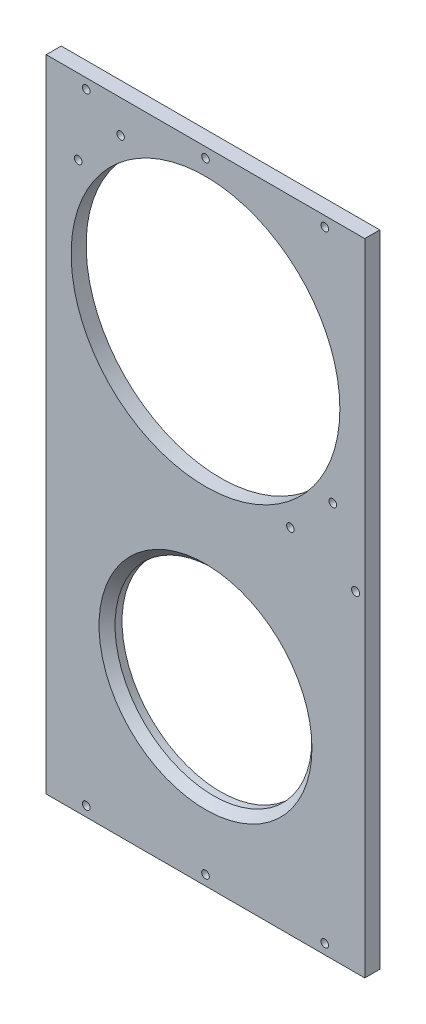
ISO-10303-21;
HEADER;
FILE_DESCRIPTION(('STEP AP214'),'2;1');
FILE_NAME('part.step','',(''),(''),'','','');
FILE_SCHEMA(('AUTOMOTIVE_DESIGN { 1 0 10303 214 1 1 1 1 }'));
ENDSEC;
DATA;
#1=APPLICATION_CONTEXT('core data for automotive mechanical design processes');
#2=APPLICATION_PROTOCOL_DEFINITION('international standard','automotive_design',2000,#1);
#3=PRODUCT_CONTEXT('',#1,'mechanical');
#4=PRODUCT('Part','Part','',(#3));
#5=PRODUCT_RELATED_PRODUCT_CATEGORY('part','',(#4));
#6=PRODUCT_DEFINITION_FORMATION('','',#4);
#7=PRODUCT_DEFINITION_CONTEXT('part definition',#1,'design');
#8=PRODUCT_DEFINITION('design','',#6,#7);
#9=PRODUCT_DEFINITION_SHAPE('','',#8);
#10=(LENGTH_UNIT() NAMED_UNIT(*) SI_UNIT(.MILLI.,.METRE.));
#11=(NAMED_UNIT(*) PLANE_ANGLE_UNIT() SI_UNIT($,.RADIAN.));
#12=(NAMED_UNIT(*) SI_UNIT($,.STERADIAN.) SOLID_ANGLE_UNIT());
#13=UNCERTAINTY_MEASURE_WITH_UNIT(LENGTH_MEASURE(1.E-05),#10,'distance_accuracy_value','');
#14=(GEOMETRIC_REPRESENTATION_CONTEXT(3) GLOBAL_UNCERTAINTY_ASSIGNED_CONTEXT((#13)) GLOBAL_UNIT_ASSIGNED_CONTEXT((#10,
#11,#12)) REPRESENTATION_CONTEXT('',''));
#15=CARTESIAN_POINT('',(0.,0.,0.));
#16=DIRECTION('',(0.,0.,1.));
#17=DIRECTION('',(1.,0.,0.));
#18=AXIS2_PLACEMENT_3D('',#15,#16,#17);
#19=CARTESIAN_POINT('',(-202.184,0.,9.525));
#20=DIRECTION('',(1.,0.,0.));
#21=DIRECTION('',(0.,1.,0.));
#22=AXIS2_PLACEMENT_3D('',#19,#20,#21);
#23=PLANE('',#22);
#24=DIRECTION('',(0.,-1.,0.));
#25=VECTOR('',#24,1.);
#26=CARTESIAN_POINT('',(-202.184,0.,0.));
#27=LINE('',#26,#25);
#28=CARTESIAN_POINT('',(-202.184,0.,0.));
#29=VERTEX_POINT('',#28);
#30=CARTESIAN_POINT('',(-202.184,-406.4,0.));
#31=VERTEX_POINT('',#30);
#32=EDGE_CURVE('E118',#29,#31,#27,.T.);
#33=ORIENTED_EDGE('',*,*,#32,.T.);
#34=DIRECTION('',(0.,0.,-1.));
#35=VECTOR('',#34,1.);
#36=CARTESIAN_POINT('',(-202.184,-406.4,9.525));
#37=LINE('',#36,#35);
#38=CARTESIAN_POINT('',(-202.184,-406.4,9.525));
#39=VERTEX_POINT('',#38);
#40=EDGE_CURVE('E107',#39,#31,#37,.T.);
#41=ORIENTED_EDGE('',*,*,#40,.F.);
#42=DIRECTION('',(0.,-1.,0.));
#43=VECTOR('',#42,1.);
#44=CARTESIAN_POINT('',(-202.184,0.,9.525));
#45=LINE('',#44,#43);
#46=CARTESIAN_POINT('',(-202.184,0.,9.525));
#47=VERTEX_POINT('',#46);
#48=EDGE_CURVE('E99',#47,#39,#45,.T.);
#49=ORIENTED_EDGE('',*,*,#48,.F.);
#50=DIRECTION('',(0.,0.,-1.));
#51=VECTOR('',#50,1.);
#52=CARTESIAN_POINT('',(-202.184,0.,9.525));
#53=LINE('',#52,#51);
#54=EDGE_CURVE('E114',#47,#29,#53,.T.);
#55=ORIENTED_EDGE('',*,*,#54,.T.);
#56=EDGE_LOOP('',(#33,#41,#49,#55));
#57=FACE_BOUND('',#56,.T.);
#58=ADVANCED_FACE('F45',(#57),#23,.F.);
#59=CARTESIAN_POINT('',(-202.184,-406.4,9.525));
#60=DIRECTION('',(0.,1.,0.));
#61=DIRECTION('',(0.,0.,1.));
#62=AXIS2_PLACEMENT_3D('',#59,#60,#61);
#63=PLANE('',#62);
#64=DIRECTION('',(1.,0.,0.));
#65=VECTOR('',#64,1.);
#66=CARTESIAN_POINT('',(-202.184,-406.4,0.));
#67=LINE('',#66,#65);
#68=CARTESIAN_POINT('',(0.,-406.4,0.));
#69=VERTEX_POINT('',#68);
#70=EDGE_CURVE('E105',#31,#69,#67,.T.);
#71=ORIENTED_EDGE('',*,*,#70,.T.);
#72=DIRECTION('',(0.,0.,-1.));
#73=VECTOR('',#72,1.);
#74=CARTESIAN_POINT('',(0.,-406.4,9.525));
#75=LINE('',#74,#73);
#76=CARTESIAN_POINT('',(0.,-406.4,9.525));
#77=VERTEX_POINT('',#76);
#78=EDGE_CURVE('E103',#77,#69,#75,.T.);
#79=ORIENTED_EDGE('',*,*,#78,.F.);
#80=DIRECTION('',(1.,0.,0.));
#81=VECTOR('',#80,1.);
#82=CARTESIAN_POINT('',(-202.184,-406.4,9.525));
#83=LINE('',#82,#81);
#84=EDGE_CURVE('E94',#39,#77,#83,.T.);
#85=ORIENTED_EDGE('',*,*,#84,.F.);
#86=ORIENTED_EDGE('',*,*,#40,.T.);
#87=EDGE_LOOP('',(#71,#79,#85,#86));
#88=FACE_BOUND('',#87,.T.);
#89=ADVANCED_FACE('F104',(#88),#63,.F.);
#90=CARTESIAN_POINT('',(0.,0.,9.525));
#91=DIRECTION('',(-1.,0.,0.));
#92=DIRECTION('',(0.,-1.,0.));
#93=AXIS2_PLACEMENT_3D('',#90,#91,#92);
#94=PLANE('',#93);
#95=DIRECTION('',(0.,1.,0.));
#96=VECTOR('',#95,1.);
#97=CARTESIAN_POINT('',(0.,0.,0.));
#98=LINE('',#97,#96);
#99=CARTESIAN_POINT('',(0.,0.,0.));
#100=VERTEX_POINT('',#99);
#101=EDGE_CURVE('E80',#69,#100,#98,.T.);
#102=ORIENTED_EDGE('',*,*,#101,.T.);
#103=DIRECTION('',(0.,0.,-1.));
#104=VECTOR('',#103,1.);
#105=CARTESIAN_POINT('',(0.,0.,9.525));
#106=LINE('',#105,#104);
#107=CARTESIAN_POINT('',(0.,0.,9.525));
#108=VERTEX_POINT('',#107);
#109=EDGE_CURVE('E108',#108,#100,#106,.T.);
#110=ORIENTED_EDGE('',*,*,#109,.F.);
#111=DIRECTION('',(0.,1.,0.));
#112=VECTOR('',#111,1.);
#113=CARTESIAN_POINT('',(0.,0.,9.525));
#114=LINE('',#113,#112);
#115=EDGE_CURVE('E97',#77,#108,#114,.T.);
#116=ORIENTED_EDGE('',*,*,#115,.F.);
#117=ORIENTED_EDGE('',*,*,#78,.T.);
#118=EDGE_LOOP('',(#102,#110,#116,#117));
#119=FACE_BOUND('',#118,.T.);
#120=ADVANCED_FACE('F110',(#119),#94,.F.);
#121=CARTESIAN_POINT('',(-202.184,0.,9.525));
#122=DIRECTION('',(0.,-1.,0.));
#123=DIRECTION('',(0.,0.,-1.));
#124=AXIS2_PLACEMENT_3D('',#121,#122,#123);
#125=PLANE('',#124);
#126=DIRECTION('',(-1.,0.,0.));
#127=VECTOR('',#126,1.);
#128=CARTESIAN_POINT('',(-202.184,0.,0.));
#129=LINE('',#128,#127);
#130=EDGE_CURVE('E86',#100,#29,#129,.T.);
#131=ORIENTED_EDGE('',*,*,#130,.T.);
#132=ORIENTED_EDGE('',*,*,#54,.F.);
#133=DIRECTION('',(-1.,0.,0.));
#134=VECTOR('',#133,1.);
#135=CARTESIAN_POINT('',(-202.184,0.,9.525));
#136=LINE('',#135,#134);
#137=EDGE_CURVE('E63',#108,#47,#136,.T.);
#138=ORIENTED_EDGE('',*,*,#137,.F.);
#139=ORIENTED_EDGE('',*,*,#109,.T.);
#140=EDGE_LOOP('',(#131,#132,#138,#139));
#141=FACE_BOUND('',#140,.T.);
#142=ADVANCED_FACE('F165',(#141),#125,.F.);
#143=CARTESIAN_POINT('',(-202.184,-406.4,9.525));
#144=DIRECTION('',(0.,0.,1.));
#145=DIRECTION('',(1.,0.,0.));
#146=AXIS2_PLACEMENT_3D('',#143,#144,#145);
#147=PLANE('',#146);
#148=CARTESIAN_POINT('',(-5.84199999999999,-196.85,9.525));
#149=DIRECTION('',(0.,0.,1.));
#150=DIRECTION('',(1.,0.,0.));
#151=AXIS2_PLACEMENT_3D('',#148,#149,#150);
#152=CIRCLE('',#151,2.54000000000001);
#153=CARTESIAN_POINT('',(-3.30199999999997,-196.85,9.525));
#154=VERTEX_POINT('',#153);
#155=EDGE_CURVE('E222',#154,#154,#152,.T.);
#156=ORIENTED_EDGE('',*,*,#155,.F.);
#157=EDGE_LOOP('',(#156));
#158=FACE_BOUND('',#157,.T.);
#159=CARTESIAN_POINT('',(-25.3999999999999,-400.05,9.525));
#160=DIRECTION('',(0.,0.,1.));
#161=DIRECTION('',(1.,0.,0.));
#162=AXIS2_PLACEMENT_3D('',#159,#160,#161);
#163=CIRCLE('',#162,2.41300000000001);
#164=CARTESIAN_POINT('',(-22.9869999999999,-400.05,9.525));
#165=VERTEX_POINT('',#164);
#166=EDGE_CURVE('E226',#165,#165,#163,.T.);
#167=ORIENTED_EDGE('',*,*,#166,.F.);
#168=EDGE_LOOP('',(#167));
#169=FACE_BOUND('',#168,.T.);
#170=CARTESIAN_POINT('',(-101.092,-400.05,9.525));
#171=DIRECTION('',(0.,0.,1.));
#172=DIRECTION('',(1.,0.,0.));
#173=AXIS2_PLACEMENT_3D('',#170,#171,#172);
#174=CIRCLE('',#173,2.413);
#175=CARTESIAN_POINT('',(-98.6789999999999,-400.05,9.525));
#176=VERTEX_POINT('',#175);
#177=EDGE_CURVE('E233',#176,#176,#174,.T.);
#178=ORIENTED_EDGE('',*,*,#177,.F.);
#179=EDGE_LOOP('',(#178));
#180=FACE_BOUND('',#179,.T.);
#181=CARTESIAN_POINT('',(-176.784,-400.05,9.525));
#182=DIRECTION('',(0.,0.,1.));
#183=DIRECTION('',(1.,0.,0.));
#184=AXIS2_PLACEMENT_3D('',#181,#182,#183);
#185=CIRCLE('',#184,2.413);
#186=CARTESIAN_POINT('',(-174.371,-400.05,9.525));
#187=VERTEX_POINT('',#186);
#188=EDGE_CURVE('E241',#187,#187,#185,.T.);
#189=ORIENTED_EDGE('',*,*,#188,.F.);
#190=EDGE_LOOP('',(#189));
#191=FACE_BOUND('',#190,.T.);
#192=CARTESIAN_POINT('',(-25.3999999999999,-6.35,9.525));
#193=DIRECTION('',(0.,0.,1.));
#194=DIRECTION('',(1.,0.,0.));
#195=AXIS2_PLACEMENT_3D('',#192,#193,#194);
#196=CIRCLE('',#195,2.413);
#197=CARTESIAN_POINT('',(-22.9869999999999,-6.35,9.525));
#198=VERTEX_POINT('',#197);
#199=EDGE_CURVE('E249',#198,#198,#196,.T.);
#200=ORIENTED_EDGE('',*,*,#199,.F.);
#201=EDGE_LOOP('',(#200));
#202=FACE_BOUND('',#201,.T.);
#203=CARTESIAN_POINT('',(-101.092,-6.35,9.525));
#204=DIRECTION('',(0.,0.,1.));
#205=DIRECTION('',(1.,0.,0.));
#206=AXIS2_PLACEMENT_3D('',#203,#204,#205);
#207=CIRCLE('',#206,2.413);
#208=CARTESIAN_POINT('',(-98.679,-6.35,9.525));
#209=VERTEX_POINT('',#208);
#210=EDGE_CURVE('E257',#209,#209,#207,.T.);
#211=ORIENTED_EDGE('',*,*,#210,.F.);
#212=EDGE_LOOP('',(#211));
#213=FACE_BOUND('',#212,.T.);
#214=CARTESIAN_POINT('',(-176.784,-6.35,9.525));
#215=DIRECTION('',(0.,0.,1.));
#216=DIRECTION('',(1.,0.,0.));
#217=AXIS2_PLACEMENT_3D('',#214,#215,#216);
#218=CIRCLE('',#217,2.413);
#219=CARTESIAN_POINT('',(-174.371,-6.35,9.525));
#220=VERTEX_POINT('',#219);
#221=EDGE_CURVE('E265',#220,#220,#218,.T.);
#222=ORIENTED_EDGE('',*,*,#221,.F.);
#223=EDGE_LOOP('',(#222));
#224=FACE_BOUND('',#223,.T.);
#225=CARTESIAN_POINT('',(-20.2696949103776,-155.481536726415,9.525));
#226=DIRECTION('',(0.,0.,1.));
#227=DIRECTION('',(1.,0.,0.));
#228=AXIS2_PLACEMENT_3D('',#225,#226,#227);
#229=CIRCLE('',#228,2.41300000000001);
#230=CARTESIAN_POINT('',(-17.8566949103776,-155.481536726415,9.525));
#231=VERTEX_POINT('',#230);
#232=EDGE_CURVE('E273',#231,#231,#229,.T.);
#233=ORIENTED_EDGE('',*,*,#232,.F.);
#234=EDGE_LOOP('',(#233));
#235=FACE_BOUND('',#234,.T.);
#236=CARTESIAN_POINT('',(-47.2104632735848,-182.422305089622,9.525));
#237=DIRECTION('',(0.,0.,1.));
#238=DIRECTION('',(1.,0.,0.));
#239=AXIS2_PLACEMENT_3D('',#236,#237,#238);
#240=CIRCLE('',#239,2.41300000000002);
#241=CARTESIAN_POINT('',(-44.7974632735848,-182.422305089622,9.525));
#242=VERTEX_POINT('',#241);
#243=EDGE_CURVE('E281',#242,#242,#240,.T.);
#244=ORIENTED_EDGE('',*,*,#243,.F.);
#245=EDGE_LOOP('',(#244));
#246=FACE_BOUND('',#245,.T.);
#247=CARTESIAN_POINT('',(-181.914305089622,-47.7184632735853,9.525));
#248=DIRECTION('',(0.,0.,1.));
#249=DIRECTION('',(1.,0.,0.));
#250=AXIS2_PLACEMENT_3D('',#247,#248,#249);
#251=CIRCLE('',#250,2.41299999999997);
#252=CARTESIAN_POINT('',(-179.501305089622,-47.7184632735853,9.525));
#253=VERTEX_POINT('',#252);
#254=EDGE_CURVE('E289',#253,#253,#251,.T.);
#255=ORIENTED_EDGE('',*,*,#254,.F.);
#256=EDGE_LOOP('',(#255));
#257=FACE_BOUND('',#256,.T.);
#258=CARTESIAN_POINT('',(-154.973536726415,-20.7776949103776,9.525));
#259=DIRECTION('',(0.,0.,1.));
#260=DIRECTION('',(1.,0.,0.));
#261=AXIS2_PLACEMENT_3D('',#258,#259,#260);
#262=CIRCLE('',#261,2.41299999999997);
#263=CARTESIAN_POINT('',(-152.560536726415,-20.7776949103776,9.525));
#264=VERTEX_POINT('',#263);
#265=EDGE_CURVE('E297',#264,#264,#262,.T.);
#266=ORIENTED_EDGE('',*,*,#265,.F.);
#267=EDGE_LOOP('',(#266));
#268=FACE_BOUND('',#267,.T.);
#269=CARTESIAN_POINT('',(-101.092,-296.8625,9.525));
#270=DIRECTION('',(0.,0.,1.));
#271=DIRECTION('',(1.,0.,0.));
#272=AXIS2_PLACEMENT_3D('',#269,#270,#271);
#273=CIRCLE('',#272,67.5640000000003);
#274=CARTESIAN_POINT('',(-33.5279999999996,-296.8625,9.525));
#275=VERTEX_POINT('',#274);
#276=EDGE_CURVE('E11',#275,#275,#273,.F.);
#277=ORIENTED_EDGE('',*,*,#276,.T.);
#278=EDGE_LOOP('',(#277));
#279=FACE_BOUND('',#278,.T.);
#280=CARTESIAN_POINT('',(-101.092,-101.6,9.525));
#281=DIRECTION('',(0.,0.,1.));
#282=DIRECTION('',(1.,0.,0.));
#283=AXIS2_PLACEMENT_3D('',#280,#281,#282);
#284=CIRCLE('',#283,85.2805);
#285=CARTESIAN_POINT('',(-15.8115,-101.6,9.525));
#286=VERTEX_POINT('',#285);
#287=EDGE_CURVE('E305',#286,#286,#284,.T.);
#288=ORIENTED_EDGE('',*,*,#287,.F.);
#289=EDGE_LOOP('',(#288));
#290=FACE_BOUND('',#289,.T.);
#291=ORIENTED_EDGE('',*,*,#48,.T.);
#292=ORIENTED_EDGE('',*,*,#84,.T.);
#293=ORIENTED_EDGE('',*,*,#115,.T.);
#294=ORIENTED_EDGE('',*,*,#137,.T.);
#295=EDGE_LOOP('',(#291,#292,#293,#294));
#296=FACE_BOUND('',#295,.T.);
#297=ADVANCED_FACE('F95',(#158,#169,#180,#191,#202,#213,#224,#235,#246,#257,#268,#279,#290,
#296),#147,.T.);
#298=CARTESIAN_POINT('',(-202.184,-406.4,0.));
#299=DIRECTION('',(0.,0.,1.));
#300=DIRECTION('',(1.,0.,0.));
#301=AXIS2_PLACEMENT_3D('',#298,#299,#300);
#302=PLANE('',#301);
#303=CARTESIAN_POINT('',(-5.84199999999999,-196.85,0.));
#304=DIRECTION('',(0.,0.,1.));
#305=DIRECTION('',(1.,0.,0.));
#306=AXIS2_PLACEMENT_3D('',#303,#304,#305);
#307=CIRCLE('',#306,2.54000000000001);
#308=CARTESIAN_POINT('',(-3.30199999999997,-196.85,0.));
#309=VERTEX_POINT('',#308);
#310=EDGE_CURVE('E219',#309,#309,#307,.T.);
#311=ORIENTED_EDGE('',*,*,#310,.T.);
#312=EDGE_LOOP('',(#311));
#313=FACE_BOUND('',#312,.T.);
#314=CARTESIAN_POINT('',(-25.3999999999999,-400.05,0.));
#315=DIRECTION('',(0.,0.,1.));
#316=DIRECTION('',(1.,0.,0.));
#317=AXIS2_PLACEMENT_3D('',#314,#315,#316);
#318=CIRCLE('',#317,2.41300000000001);
#319=CARTESIAN_POINT('',(-22.9869999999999,-400.05,0.));
#320=VERTEX_POINT('',#319);
#321=EDGE_CURVE('E229',#320,#320,#318,.T.);
#322=ORIENTED_EDGE('',*,*,#321,.T.);
#323=EDGE_LOOP('',(#322));
#324=FACE_BOUND('',#323,.T.);
#325=CARTESIAN_POINT('',(-101.092,-400.05,0.));
#326=DIRECTION('',(0.,0.,1.));
#327=DIRECTION('',(1.,0.,0.));
#328=AXIS2_PLACEMENT_3D('',#325,#326,#327);
#329=CIRCLE('',#328,2.413);
#330=CARTESIAN_POINT('',(-98.6789999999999,-400.05,0.));
#331=VERTEX_POINT('',#330);
#332=EDGE_CURVE('E237',#331,#331,#329,.T.);
#333=ORIENTED_EDGE('',*,*,#332,.T.);
#334=EDGE_LOOP('',(#333));
#335=FACE_BOUND('',#334,.T.);
#336=CARTESIAN_POINT('',(-176.784,-400.05,0.));
#337=DIRECTION('',(0.,0.,1.));
#338=DIRECTION('',(1.,0.,0.));
#339=AXIS2_PLACEMENT_3D('',#336,#337,#338);
#340=CIRCLE('',#339,2.413);
#341=CARTESIAN_POINT('',(-174.371,-400.05,0.));
#342=VERTEX_POINT('',#341);
#343=EDGE_CURVE('E245',#342,#342,#340,.T.);
#344=ORIENTED_EDGE('',*,*,#343,.T.);
#345=EDGE_LOOP('',(#344));
#346=FACE_BOUND('',#345,.T.);
#347=CARTESIAN_POINT('',(-25.3999999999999,-6.35,0.));
#348=DIRECTION('',(0.,0.,1.));
#349=DIRECTION('',(1.,0.,0.));
#350=AXIS2_PLACEMENT_3D('',#347,#348,#349);
#351=CIRCLE('',#350,2.413);
#352=CARTESIAN_POINT('',(-22.9869999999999,-6.35,0.));
#353=VERTEX_POINT('',#352);
#354=EDGE_CURVE('E253',#353,#353,#351,.T.);
#355=ORIENTED_EDGE('',*,*,#354,.T.);
#356=EDGE_LOOP('',(#355));
#357=FACE_BOUND('',#356,.T.);
#358=CARTESIAN_POINT('',(-101.092,-6.35,0.));
#359=DIRECTION('',(0.,0.,1.));
#360=DIRECTION('',(1.,0.,0.));
#361=AXIS2_PLACEMENT_3D('',#358,#359,#360);
#362=CIRCLE('',#361,2.413);
#363=CARTESIAN_POINT('',(-98.679,-6.35,0.));
#364=VERTEX_POINT('',#363);
#365=EDGE_CURVE('E261',#364,#364,#362,.T.);
#366=ORIENTED_EDGE('',*,*,#365,.T.);
#367=EDGE_LOOP('',(#366));
#368=FACE_BOUND('',#367,.T.);
#369=CARTESIAN_POINT('',(-176.784,-6.35,0.));
#370=DIRECTION('',(0.,0.,1.));
#371=DIRECTION('',(1.,0.,0.));
#372=AXIS2_PLACEMENT_3D('',#369,#370,#371);
#373=CIRCLE('',#372,2.413);
#374=CARTESIAN_POINT('',(-174.371,-6.35,0.));
#375=VERTEX_POINT('',#374);
#376=EDGE_CURVE('E269',#375,#375,#373,.T.);
#377=ORIENTED_EDGE('',*,*,#376,.T.);
#378=EDGE_LOOP('',(#377));
#379=FACE_BOUND('',#378,.T.);
#380=CARTESIAN_POINT('',(-20.2696949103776,-155.481536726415,0.));
#381=DIRECTION('',(0.,0.,1.));
#382=DIRECTION('',(1.,0.,0.));
#383=AXIS2_PLACEMENT_3D('',#380,#381,#382);
#384=CIRCLE('',#383,2.41300000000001);
#385=CARTESIAN_POINT('',(-17.8566949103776,-155.481536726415,0.));
#386=VERTEX_POINT('',#385);
#387=EDGE_CURVE('E277',#386,#386,#384,.T.);
#388=ORIENTED_EDGE('',*,*,#387,.T.);
#389=EDGE_LOOP('',(#388));
#390=FACE_BOUND('',#389,.T.);
#391=CARTESIAN_POINT('',(-47.2104632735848,-182.422305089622,0.));
#392=DIRECTION('',(0.,0.,1.));
#393=DIRECTION('',(1.,0.,0.));
#394=AXIS2_PLACEMENT_3D('',#391,#392,#393);
#395=CIRCLE('',#394,2.41300000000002);
#396=CARTESIAN_POINT('',(-44.7974632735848,-182.422305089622,0.));
#397=VERTEX_POINT('',#396);
#398=EDGE_CURVE('E285',#397,#397,#395,.T.);
#399=ORIENTED_EDGE('',*,*,#398,.T.);
#400=EDGE_LOOP('',(#399));
#401=FACE_BOUND('',#400,.T.);
#402=CARTESIAN_POINT('',(-181.914305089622,-47.7184632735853,0.));
#403=DIRECTION('',(0.,0.,1.));
#404=DIRECTION('',(1.,0.,0.));
#405=AXIS2_PLACEMENT_3D('',#402,#403,#404);
#406=CIRCLE('',#405,2.41299999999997);
#407=CARTESIAN_POINT('',(-179.501305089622,-47.7184632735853,0.));
#408=VERTEX_POINT('',#407);
#409=EDGE_CURVE('E293',#408,#408,#406,.T.);
#410=ORIENTED_EDGE('',*,*,#409,.T.);
#411=EDGE_LOOP('',(#410));
#412=FACE_BOUND('',#411,.T.);
#413=CARTESIAN_POINT('',(-154.973536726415,-20.7776949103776,0.));
#414=DIRECTION('',(0.,0.,1.));
#415=DIRECTION('',(1.,0.,0.));
#416=AXIS2_PLACEMENT_3D('',#413,#414,#415);
#417=CIRCLE('',#416,2.41299999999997);
#418=CARTESIAN_POINT('',(-152.560536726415,-20.7776949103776,0.));
#419=VERTEX_POINT('',#418);
#420=EDGE_CURVE('E301',#419,#419,#417,.T.);
#421=ORIENTED_EDGE('',*,*,#420,.T.);
#422=EDGE_LOOP('',(#421));
#423=FACE_BOUND('',#422,.T.);
#424=CARTESIAN_POINT('',(-101.092,-101.6,0.));
#425=DIRECTION('',(0.,0.,1.));
#426=DIRECTION('',(1.,0.,0.));
#427=AXIS2_PLACEMENT_3D('',#424,#425,#426);
#428=CIRCLE('',#427,85.2805);
#429=CARTESIAN_POINT('',(-15.8115,-101.6,0.));
#430=VERTEX_POINT('',#429);
#431=EDGE_CURVE('E309',#430,#430,#428,.T.);
#432=ORIENTED_EDGE('',*,*,#431,.T.);
#433=EDGE_LOOP('',(#432));
#434=FACE_BOUND('',#433,.T.);
#435=CARTESIAN_POINT('',(-101.092,-296.8625,0.));
#436=DIRECTION('',(0.,0.,1.));
#437=DIRECTION('',(1.,0.,0.));
#438=AXIS2_PLACEMENT_3D('',#435,#436,#437);
#439=CIRCLE('',#438,62.484);
#440=CARTESIAN_POINT('',(-38.6079999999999,-296.8625,0.));
#441=VERTEX_POINT('',#440);
#442=EDGE_CURVE('E122',#441,#441,#439,.T.);
#443=ORIENTED_EDGE('',*,*,#442,.T.);
#444=EDGE_LOOP('',(#443));
#445=FACE_BOUND('',#444,.T.);
#446=ORIENTED_EDGE('',*,*,#32,.F.);
#447=ORIENTED_EDGE('',*,*,#130,.F.);
#448=ORIENTED_EDGE('',*,*,#101,.F.);
#449=ORIENTED_EDGE('',*,*,#70,.F.);
#450=EDGE_LOOP('',(#446,#447,#448,#449));
#451=FACE_BOUND('',#450,.T.);
#452=ADVANCED_FACE('F168',(#313,#324,#335,#346,#357,#368,#379,#390,#401,#412,#423,#434,#445,
#451),#302,.F.);
#453=CARTESIAN_POINT('',(-101.092,-296.8625,0.));
#454=DIRECTION('',(0.,0.,1.));
#455=DIRECTION('',(1.,0.,0.));
#456=AXIS2_PLACEMENT_3D('',#453,#454,#455);
#457=CYLINDRICAL_SURFACE('',#456,62.484);
#458=CARTESIAN_POINT('',(-101.092,-296.8625,4.44499999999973));
#459=DIRECTION('',(0.,0.,1.));
#460=DIRECTION('',(1.,0.,0.));
#461=AXIS2_PLACEMENT_3D('',#458,#459,#460);
#462=CIRCLE('',#461,62.484);
#463=CARTESIAN_POINT('',(-38.6079999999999,-296.8625,4.44499999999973));
#464=VERTEX_POINT('',#463);
#465=EDGE_CURVE('E55',#464,#464,#462,.T.);
#466=CARTESIAN_POINT('',(-38.6079999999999,-296.8625,4.44499999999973));
#467=CARTESIAN_POINT('',(-38.6079999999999,-296.8625,4.3986979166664));
#468=CARTESIAN_POINT('',(-38.6079999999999,-296.8625,4.35239583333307));
#469=CARTESIAN_POINT('',(-38.6079999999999,-296.8625,4.25979166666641));
#470=CARTESIAN_POINT('',(-38.6079999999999,-296.8625,4.21348958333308));
#471=CARTESIAN_POINT('',(-38.6079999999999,-296.8625,4.12088541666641));
#472=CARTESIAN_POINT('',(-38.6079999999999,-296.8625,4.07458333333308));
#473=CARTESIAN_POINT('',(-38.6079999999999,-296.8625,3.98197916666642));
#474=CARTESIAN_POINT('',(-38.6079999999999,-296.8625,3.93567708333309));
#475=CARTESIAN_POINT('',(-38.6079999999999,-296.8625,3.84307291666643));
#476=CARTESIAN_POINT('',(-38.6079999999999,-296.8625,3.7967708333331));
#477=CARTESIAN_POINT('',(-38.6079999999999,-296.8625,3.70416666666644));
#478=CARTESIAN_POINT('',(-38.6079999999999,-296.8625,3.65786458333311));
#479=CARTESIAN_POINT('',(-38.6079999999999,-296.8625,3.56526041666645));
#480=CARTESIAN_POINT('',(-38.6079999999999,-296.8625,3.51895833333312));
#481=CARTESIAN_POINT('',(-38.6079999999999,-296.8625,3.42635416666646));
#482=CARTESIAN_POINT('',(-38.6079999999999,-296.8625,3.38005208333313));
#483=CARTESIAN_POINT('',(-38.6079999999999,-296.8625,3.28744791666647));
#484=CARTESIAN_POINT('',(-38.6079999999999,-296.8625,3.24114583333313));
#485=CARTESIAN_POINT('',(-38.6079999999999,-296.8625,3.14854166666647));
#486=CARTESIAN_POINT('',(-38.6079999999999,-296.8625,3.10223958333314));
#487=CARTESIAN_POINT('',(-38.6079999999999,-296.8625,3.00963541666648));
#488=CARTESIAN_POINT('',(-38.6079999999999,-296.8625,2.96333333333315));
#489=CARTESIAN_POINT('',(-38.6079999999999,-296.8625,2.87072916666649));
#490=CARTESIAN_POINT('',(-38.6079999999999,-296.8625,2.82442708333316));
#491=CARTESIAN_POINT('',(-38.6079999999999,-296.8625,2.7318229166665));
#492=CARTESIAN_POINT('',(-38.6079999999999,-296.8625,2.68552083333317));
#493=CARTESIAN_POINT('',(-38.6079999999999,-296.8625,2.59291666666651));
#494=CARTESIAN_POINT('',(-38.6079999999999,-296.8625,2.54661458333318));
#495=CARTESIAN_POINT('',(-38.6079999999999,-296.8625,2.45401041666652));
#496=CARTESIAN_POINT('',(-38.6079999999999,-296.8625,2.40770833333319));
#497=CARTESIAN_POINT('',(-38.6079999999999,-296.8625,2.31510416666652));
#498=CARTESIAN_POINT('',(-38.6079999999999,-296.8625,2.26880208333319));
#499=CARTESIAN_POINT('',(-38.6079999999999,-296.8625,2.17619791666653));
#500=CARTESIAN_POINT('',(-38.6079999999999,-296.8625,2.1298958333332));
#501=CARTESIAN_POINT('',(-38.6079999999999,-296.8625,2.03729166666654));
#502=CARTESIAN_POINT('',(-38.6079999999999,-296.8625,1.99098958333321));
#503=CARTESIAN_POINT('',(-38.6079999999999,-296.8625,1.89838541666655));
#504=CARTESIAN_POINT('',(-38.6079999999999,-296.8625,1.85208333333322));
#505=CARTESIAN_POINT('',(-38.6079999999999,-296.8625,1.75947916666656));
#506=CARTESIAN_POINT('',(-38.6079999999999,-296.8625,1.71317708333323));
#507=CARTESIAN_POINT('',(-38.6079999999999,-296.8625,1.62057291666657));
#508=CARTESIAN_POINT('',(-38.6079999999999,-296.8625,1.57427083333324));
#509=CARTESIAN_POINT('',(-38.6079999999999,-296.8625,1.48166666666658));
#510=CARTESIAN_POINT('',(-38.6079999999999,-296.8625,1.43536458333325));
#511=CARTESIAN_POINT('',(-38.6079999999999,-296.8625,1.34276041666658));
#512=CARTESIAN_POINT('',(-38.6079999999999,-296.8625,1.29645833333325));
#513=CARTESIAN_POINT('',(-38.6079999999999,-296.8625,1.20385416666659));
#514=CARTESIAN_POINT('',(-38.6079999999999,-296.8625,1.15755208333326));
#515=CARTESIAN_POINT('',(-38.6079999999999,-296.8625,1.0649479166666));
#516=CARTESIAN_POINT('',(-38.6079999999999,-296.8625,1.01864583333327));
#517=CARTESIAN_POINT('',(-38.6079999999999,-296.8625,0.92604166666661));
#518=CARTESIAN_POINT('',(-38.6079999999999,-296.8625,0.87973958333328));
#519=CARTESIAN_POINT('',(-38.6079999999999,-296.8625,0.787135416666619));
#520=CARTESIAN_POINT('',(-38.6079999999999,-296.8625,0.740833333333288));
#521=CARTESIAN_POINT('',(-38.6079999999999,-296.8625,0.648229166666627));
#522=CARTESIAN_POINT('',(-38.6079999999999,-296.8625,0.601927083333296));
#523=CARTESIAN_POINT('',(-38.6079999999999,-296.8625,0.509322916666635));
#524=CARTESIAN_POINT('',(-38.6079999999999,-296.8625,0.463020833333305));
#525=CARTESIAN_POINT('',(-38.6079999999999,-296.8625,0.370416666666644));
#526=CARTESIAN_POINT('',(-38.6079999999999,-296.8625,0.324114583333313));
#527=CARTESIAN_POINT('',(-38.6079999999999,-296.8625,0.231510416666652));
#528=CARTESIAN_POINT('',(-38.6079999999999,-296.8625,0.185208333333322));
#529=CARTESIAN_POINT('',(-38.6079999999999,-296.8625,0.092604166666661));
#530=CARTESIAN_POINT('',(-38.6079999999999,-296.8625,0.0463020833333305));
#531=CARTESIAN_POINT('',(-38.6079999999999,-296.8625,0.));
#532=B_SPLINE_CURVE_WITH_KNOTS('',3,(#466,#467,#468,#469,#470,#471,#472,#473,#474,#475,#476,
#477,#478,#479,#480,#481,#482,#483,#484,#485,#486,#487,#488,#489,#490,#491,#492,#493,#494,#495,
#496,#497,#498,#499,#500,#501,#502,#503,#504,#505,#506,#507,#508,#509,#510,#511,#512,#513,#514,
#515,#516,#517,#518,#519,#520,#521,#522,#523,#524,#525,#526,#527,#528,#529,#530,#531),
.UNSPECIFIED.,.F.,.F.,(4,2,2,2,2,2,2,2,2,2,2,2,2,2,2,2,2,2,2,2,2,2,2,2,2,2,2,2,2,2,2,2,4),(0.,
0.138906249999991,0.277812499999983,0.416718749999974,0.555624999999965,0.694531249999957,
0.833437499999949,0.97234374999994,1.11124999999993,1.25015624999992,1.38906249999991,
1.52796874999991,1.6668749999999,1.80578124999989,1.94468749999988,2.08359374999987,
2.22249999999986,2.36140624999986,2.50031249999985,2.63921874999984,2.77812499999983,
2.91703124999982,3.05593749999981,3.1948437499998,3.3337499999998,3.47265624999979,
3.61156249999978,3.75046874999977,3.88937499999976,4.02828124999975,4.16718749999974,
4.30609374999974,4.44499999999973),.UNSPECIFIED.);
#533=EDGE_CURVE('BSEAM138',#464,#441,#532,.T.);
#534=ORIENTED_EDGE('',*,*,#465,.T.);
#535=ORIENTED_EDGE('',*,*,#442,.F.);
#536=ORIENTED_EDGE('',*,*,#533,.T.);
#537=ORIENTED_EDGE('',*,*,#533,.F.);
#538=EDGE_LOOP('',(#534,#536,#535,#537));
#539=FACE_BOUND('',#538,.T.);
#540=ADVANCED_FACE('F138',(#539),#457,.F.);
#541=CARTESIAN_POINT('',(-101.092,-101.6,0.));
#542=DIRECTION('',(0.,0.,1.));
#543=DIRECTION('',(1.,0.,0.));
#544=AXIS2_PLACEMENT_3D('',#541,#542,#543);
#545=CYLINDRICAL_SURFACE('',#544,85.2805);
#546=CARTESIAN_POINT('',(-15.8115,-101.6,0.));
#547=CARTESIAN_POINT('',(-15.8115,-101.6,0.0992187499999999));
#548=CARTESIAN_POINT('',(-15.8115,-101.6,0.1984375));
#549=CARTESIAN_POINT('',(-15.8115,-101.6,0.396875));
#550=CARTESIAN_POINT('',(-15.8115,-101.6,0.49609375));
#551=CARTESIAN_POINT('',(-15.8115,-101.6,0.69453125));
#552=CARTESIAN_POINT('',(-15.8115,-101.6,0.79375));
#553=CARTESIAN_POINT('',(-15.8115,-101.6,0.9921875));
#554=CARTESIAN_POINT('',(-15.8115,-101.6,1.09140625));
#555=CARTESIAN_POINT('',(-15.8115,-101.6,1.28984375));
#556=CARTESIAN_POINT('',(-15.8115,-101.6,1.3890625));
#557=CARTESIAN_POINT('',(-15.8115,-101.6,1.5875));
#558=CARTESIAN_POINT('',(-15.8115,-101.6,1.68671875));
#559=CARTESIAN_POINT('',(-15.8115,-101.6,1.88515625));
#560=CARTESIAN_POINT('',(-15.8115,-101.6,1.984375));
#561=CARTESIAN_POINT('',(-15.8115,-101.6,2.1828125));
#562=CARTESIAN_POINT('',(-15.8115,-101.6,2.28203125));
#563=CARTESIAN_POINT('',(-15.8115,-101.6,2.48046875));
#564=CARTESIAN_POINT('',(-15.8115,-101.6,2.5796875));
#565=CARTESIAN_POINT('',(-15.8115,-101.6,2.778125));
#566=CARTESIAN_POINT('',(-15.8115,-101.6,2.87734375));
#567=CARTESIAN_POINT('',(-15.8115,-101.6,3.07578125));
#568=CARTESIAN_POINT('',(-15.8115,-101.6,3.175));
#569=CARTESIAN_POINT('',(-15.8115,-101.6,3.3734375));
#570=CARTESIAN_POINT('',(-15.8115,-101.6,3.47265625));
#571=CARTESIAN_POINT('',(-15.8115,-101.6,3.67109375));
#572=CARTESIAN_POINT('',(-15.8115,-101.6,3.7703125));
#573=CARTESIAN_POINT('',(-15.8115,-101.6,3.96875));
#574=CARTESIAN_POINT('',(-15.8115,-101.6,4.06796875));
#575=CARTESIAN_POINT('',(-15.8115,-101.6,4.26640625));
#576=CARTESIAN_POINT('',(-15.8115,-101.6,4.365625));
#577=CARTESIAN_POINT('',(-15.8115,-101.6,4.5640625));
#578=CARTESIAN_POINT('',(-15.8115,-101.6,4.66328125));
#579=CARTESIAN_POINT('',(-15.8115,-101.6,4.86171875));
#580=CARTESIAN_POINT('',(-15.8115,-101.6,4.9609375));
#581=CARTESIAN_POINT('',(-15.8115,-101.6,5.159375));
#582=CARTESIAN_POINT('',(-15.8115,-101.6,5.25859375));
#583=CARTESIAN_POINT('',(-15.8115,-101.6,5.45703125));
#584=CARTESIAN_POINT('',(-15.8115,-101.6,5.55625));
#585=CARTESIAN_POINT('',(-15.8115,-101.6,5.7546875));
#586=CARTESIAN_POINT('',(-15.8115,-101.6,5.85390625));
#587=CARTESIAN_POINT('',(-15.8115,-101.6,6.05234375));
#588=CARTESIAN_POINT('',(-15.8115,-101.6,6.1515625));
#589=CARTESIAN_POINT('',(-15.8115,-101.6,6.35));
#590=CARTESIAN_POINT('',(-15.8115,-101.6,6.44921875));
#591=CARTESIAN_POINT('',(-15.8115,-101.6,6.64765625));
#592=CARTESIAN_POINT('',(-15.8115,-101.6,6.746875));
#593=CARTESIAN_POINT('',(-15.8115,-101.6,6.9453125));
#594=CARTESIAN_POINT('',(-15.8115,-101.6,7.04453125));
#595=CARTESIAN_POINT('',(-15.8115,-101.6,7.24296875));
#596=CARTESIAN_POINT('',(-15.8115,-101.6,7.3421875));
#597=CARTESIAN_POINT('',(-15.8115,-101.6,7.540625));
#598=CARTESIAN_POINT('',(-15.8115,-101.6,7.63984375));
#599=CARTESIAN_POINT('',(-15.8115,-101.6,7.83828125));
#600=CARTESIAN_POINT('',(-15.8115,-101.6,7.9375));
#601=CARTESIAN_POINT('',(-15.8115,-101.6,8.1359375));
#602=CARTESIAN_POINT('',(-15.8115,-101.6,8.23515625));
#603=CARTESIAN_POINT('',(-15.8115,-101.6,8.43359375));
#604=CARTESIAN_POINT('',(-15.8115,-101.6,8.5328125));
#605=CARTESIAN_POINT('',(-15.8115,-101.6,8.73125));
#606=CARTESIAN_POINT('',(-15.8115,-101.6,8.83046875));
#607=CARTESIAN_POINT('',(-15.8115,-101.6,9.02890625));
#608=CARTESIAN_POINT('',(-15.8115,-101.6,9.128125));
#609=CARTESIAN_POINT('',(-15.8115,-101.6,9.3265625));
#610=CARTESIAN_POINT('',(-15.8115,-101.6,9.42578125));
#611=CARTESIAN_POINT('',(-15.8115,-101.6,9.525));
#612=B_SPLINE_CURVE_WITH_KNOTS('',3,(#546,#547,#548,#549,#550,#551,#552,#553,#554,#555,#556,
#557,#558,#559,#560,#561,#562,#563,#564,#565,#566,#567,#568,#569,#570,#571,#572,#573,#574,#575,
#576,#577,#578,#579,#580,#581,#582,#583,#584,#585,#586,#587,#588,#589,#590,#591,#592,#593,#594,
#595,#596,#597,#598,#599,#600,#601,#602,#603,#604,#605,#606,#607,#608,#609,#610,#611),
.UNSPECIFIED.,.F.,.F.,(4,2,2,2,2,2,2,2,2,2,2,2,2,2,2,2,2,2,2,2,2,2,2,2,2,2,2,2,2,2,2,2,4),(0.,
0.29765625,0.5953125,0.89296875,1.190625,1.48828125,1.7859375,2.08359375,2.38125,2.67890625,
2.9765625,3.27421875,3.571875,3.86953125,4.1671875,4.46484375,4.7625,5.06015625,5.3578125,
5.65546875,5.953125,6.25078125,6.5484375,6.84609375,7.14375,7.44140625,7.7390625,8.03671875,
8.334375,8.63203125,8.9296875,9.22734375,9.525),.UNSPECIFIED.);
#613=EDGE_CURVE('BSEAM143',#430,#286,#612,.T.);
#614=ORIENTED_EDGE('',*,*,#431,.F.);
#615=ORIENTED_EDGE('',*,*,#287,.T.);
#616=ORIENTED_EDGE('',*,*,#613,.T.);
#617=ORIENTED_EDGE('',*,*,#613,.F.);
#618=EDGE_LOOP('',(#614,#616,#615,#617));
#619=FACE_BOUND('',#618,.T.);
#620=ADVANCED_FACE('F143',(#619),#545,.F.);
#621=CARTESIAN_POINT('',(-101.092,-296.8625,4.44499999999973));
#622=DIRECTION('',(0.,0.,1.));
#623=DIRECTION('',(1.,0.,0.));
#624=AXIS2_PLACEMENT_3D('',#621,#622,#623);
#625=CONICAL_SURFACE('',#624,62.484,0.785398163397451);
#626=ORIENTED_EDGE('',*,*,#276,.F.);
#627=EDGE_LOOP('',(#626));
#628=FACE_BOUND('',#627,.T.);
#629=ORIENTED_EDGE('',*,*,#465,.F.);
#630=EDGE_LOOP('',(#629));
#631=FACE_BOUND('',#630,.T.);
#632=ADVANCED_FACE('F47',(#628,#631),#625,.F.);
#633=CARTESIAN_POINT('',(-154.973536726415,-20.7776949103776,0.));
#634=DIRECTION('',(0.,0.,1.));
#635=DIRECTION('',(1.,0.,0.));
#636=AXIS2_PLACEMENT_3D('',#633,#634,#635);
#637=CYLINDRICAL_SURFACE('',#636,2.41299999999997);
#638=CARTESIAN_POINT('',(-152.560536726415,-20.7776949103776,0.));
#639=CARTESIAN_POINT('',(-152.560536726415,-20.7776949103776,0.0992187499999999));
#640=CARTESIAN_POINT('',(-152.560536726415,-20.7776949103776,0.1984375));
#641=CARTESIAN_POINT('',(-152.560536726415,-20.7776949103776,0.396875));
#642=CARTESIAN_POINT('',(-152.560536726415,-20.7776949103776,0.49609375));
#643=CARTESIAN_POINT('',(-152.560536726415,-20.7776949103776,0.69453125));
#644=CARTESIAN_POINT('',(-152.560536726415,-20.7776949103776,0.79375));
#645=CARTESIAN_POINT('',(-152.560536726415,-20.7776949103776,0.9921875));
#646=CARTESIAN_POINT('',(-152.560536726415,-20.7776949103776,1.09140625));
#647=CARTESIAN_POINT('',(-152.560536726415,-20.7776949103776,1.28984375));
#648=CARTESIAN_POINT('',(-152.560536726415,-20.7776949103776,1.3890625));
#649=CARTESIAN_POINT('',(-152.560536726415,-20.7776949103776,1.5875));
#650=CARTESIAN_POINT('',(-152.560536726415,-20.7776949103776,1.68671875));
#651=CARTESIAN_POINT('',(-152.560536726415,-20.7776949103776,1.88515625));
#652=CARTESIAN_POINT('',(-152.560536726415,-20.7776949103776,1.984375));
#653=CARTESIAN_POINT('',(-152.560536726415,-20.7776949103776,2.1828125));
#654=CARTESIAN_POINT('',(-152.560536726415,-20.7776949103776,2.28203125));
#655=CARTESIAN_POINT('',(-152.560536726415,-20.7776949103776,2.48046875));
#656=CARTESIAN_POINT('',(-152.560536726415,-20.7776949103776,2.5796875));
#657=CARTESIAN_POINT('',(-152.560536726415,-20.7776949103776,2.778125));
#658=CARTESIAN_POINT('',(-152.560536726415,-20.7776949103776,2.87734375));
#659=CARTESIAN_POINT('',(-152.560536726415,-20.7776949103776,3.07578125));
#660=CARTESIAN_POINT('',(-152.560536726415,-20.7776949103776,3.175));
#661=CARTESIAN_POINT('',(-152.560536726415,-20.7776949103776,3.3734375));
#662=CARTESIAN_POINT('',(-152.560536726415,-20.7776949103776,3.47265625));
#663=CARTESIAN_POINT('',(-152.560536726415,-20.7776949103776,3.67109375));
#664=CARTESIAN_POINT('',(-152.560536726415,-20.7776949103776,3.7703125));
#665=CARTESIAN_POINT('',(-152.560536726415,-20.7776949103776,3.96875));
#666=CARTESIAN_POINT('',(-152.560536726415,-20.7776949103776,4.06796875));
#667=CARTESIAN_POINT('',(-152.560536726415,-20.7776949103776,4.26640625));
#668=CARTESIAN_POINT('',(-152.560536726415,-20.7776949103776,4.365625));
#669=CARTESIAN_POINT('',(-152.560536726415,-20.7776949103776,4.5640625));
#670=CARTESIAN_POINT('',(-152.560536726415,-20.7776949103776,4.66328125));
#671=CARTESIAN_POINT('',(-152.560536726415,-20.7776949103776,4.86171875));
#672=CARTESIAN_POINT('',(-152.560536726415,-20.7776949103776,4.9609375));
#673=CARTESIAN_POINT('',(-152.560536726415,-20.7776949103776,5.159375));
#674=CARTESIAN_POINT('',(-152.560536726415,-20.7776949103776,5.25859375));
#675=CARTESIAN_POINT('',(-152.560536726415,-20.7776949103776,5.45703125));
#676=CARTESIAN_POINT('',(-152.560536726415,-20.7776949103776,5.55625));
#677=CARTESIAN_POINT('',(-152.560536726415,-20.7776949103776,5.7546875));
#678=CARTESIAN_POINT('',(-152.560536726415,-20.7776949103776,5.85390625));
#679=CARTESIAN_POINT('',(-152.560536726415,-20.7776949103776,6.05234375));
#680=CARTESIAN_POINT('',(-152.560536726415,-20.7776949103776,6.1515625));
#681=CARTESIAN_POINT('',(-152.560536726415,-20.7776949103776,6.35));
#682=CARTESIAN_POINT('',(-152.560536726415,-20.7776949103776,6.44921875));
#683=CARTESIAN_POINT('',(-152.560536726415,-20.7776949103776,6.64765625));
#684=CARTESIAN_POINT('',(-152.560536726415,-20.7776949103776,6.746875));
#685=CARTESIAN_POINT('',(-152.560536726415,-20.7776949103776,6.9453125));
#686=CARTESIAN_POINT('',(-152.560536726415,-20.7776949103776,7.04453125));
#687=CARTESIAN_POINT('',(-152.560536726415,-20.7776949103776,7.24296875));
#688=CARTESIAN_POINT('',(-152.560536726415,-20.7776949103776,7.3421875));
#689=CARTESIAN_POINT('',(-152.560536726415,-20.7776949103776,7.540625));
#690=CARTESIAN_POINT('',(-152.560536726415,-20.7776949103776,7.63984375));
#691=CARTESIAN_POINT('',(-152.560536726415,-20.7776949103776,7.83828125));
#692=CARTESIAN_POINT('',(-152.560536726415,-20.7776949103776,7.9375));
#693=CARTESIAN_POINT('',(-152.560536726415,-20.7776949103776,8.1359375));
#694=CARTESIAN_POINT('',(-152.560536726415,-20.7776949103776,8.23515625));
#695=CARTESIAN_POINT('',(-152.560536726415,-20.7776949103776,8.43359375));
#696=CARTESIAN_POINT('',(-152.560536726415,-20.7776949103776,8.5328125));
#697=CARTESIAN_POINT('',(-152.560536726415,-20.7776949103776,8.73125));
#698=CARTESIAN_POINT('',(-152.560536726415,-20.7776949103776,8.83046875));
#699=CARTESIAN_POINT('',(-152.560536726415,-20.7776949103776,9.02890625));
#700=CARTESIAN_POINT('',(-152.560536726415,-20.7776949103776,9.128125));
#701=CARTESIAN_POINT('',(-152.560536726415,-20.7776949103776,9.3265625));
#702=CARTESIAN_POINT('',(-152.560536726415,-20.7776949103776,9.42578125));
#703=CARTESIAN_POINT('',(-152.560536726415,-20.7776949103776,9.525));
#704=B_SPLINE_CURVE_WITH_KNOTS('',3,(#638,#639,#640,#641,#642,#643,#644,#645,#646,#647,#648,
#649,#650,#651,#652,#653,#654,#655,#656,#657,#658,#659,#660,#661,#662,#663,#664,#665,#666,#667,
#668,#669,#670,#671,#672,#673,#674,#675,#676,#677,#678,#679,#680,#681,#682,#683,#684,#685,#686,
#687,#688,#689,#690,#691,#692,#693,#694,#695,#696,#697,#698,#699,#700,#701,#702,#703),
.UNSPECIFIED.,.F.,.F.,(4,2,2,2,2,2,2,2,2,2,2,2,2,2,2,2,2,2,2,2,2,2,2,2,2,2,2,2,2,2,2,2,4),(0.,
0.29765625,0.5953125,0.89296875,1.190625,1.48828125,1.7859375,2.08359375,2.38125,2.67890625,
2.9765625,3.27421875,3.571875,3.86953125,4.1671875,4.46484375,4.7625,5.06015625,5.3578125,
5.65546875,5.953125,6.25078125,6.5484375,6.84609375,7.14375,7.44140625,7.7390625,8.03671875,
8.334375,8.63203125,8.9296875,9.22734375,9.525),.UNSPECIFIED.);
#705=EDGE_CURVE('BSEAM142',#419,#264,#704,.T.);
#706=ORIENTED_EDGE('',*,*,#420,.F.);
#707=ORIENTED_EDGE('',*,*,#265,.T.);
#708=ORIENTED_EDGE('',*,*,#705,.T.);
#709=ORIENTED_EDGE('',*,*,#705,.F.);
#710=EDGE_LOOP('',(#706,#708,#707,#709));
#711=FACE_BOUND('',#710,.T.);
#712=ADVANCED_FACE('F142',(#711),#637,.F.);
#713=CARTESIAN_POINT('',(-181.914305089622,-47.7184632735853,0.));
#714=DIRECTION('',(0.,0.,1.));
#715=DIRECTION('',(1.,0.,0.));
#716=AXIS2_PLACEMENT_3D('',#713,#714,#715);
#717=CYLINDRICAL_SURFACE('',#716,2.41299999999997);
#718=CARTESIAN_POINT('',(-179.501305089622,-47.7184632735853,0.));
#719=CARTESIAN_POINT('',(-179.501305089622,-47.7184632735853,0.0992187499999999));
#720=CARTESIAN_POINT('',(-179.501305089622,-47.7184632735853,0.1984375));
#721=CARTESIAN_POINT('',(-179.501305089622,-47.7184632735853,0.396875));
#722=CARTESIAN_POINT('',(-179.501305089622,-47.7184632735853,0.49609375));
#723=CARTESIAN_POINT('',(-179.501305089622,-47.7184632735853,0.69453125));
#724=CARTESIAN_POINT('',(-179.501305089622,-47.7184632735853,0.79375));
#725=CARTESIAN_POINT('',(-179.501305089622,-47.7184632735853,0.9921875));
#726=CARTESIAN_POINT('',(-179.501305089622,-47.7184632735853,1.09140625));
#727=CARTESIAN_POINT('',(-179.501305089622,-47.7184632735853,1.28984375));
#728=CARTESIAN_POINT('',(-179.501305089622,-47.7184632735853,1.3890625));
#729=CARTESIAN_POINT('',(-179.501305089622,-47.7184632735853,1.5875));
#730=CARTESIAN_POINT('',(-179.501305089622,-47.7184632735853,1.68671875));
#731=CARTESIAN_POINT('',(-179.501305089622,-47.7184632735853,1.88515625));
#732=CARTESIAN_POINT('',(-179.501305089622,-47.7184632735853,1.984375));
#733=CARTESIAN_POINT('',(-179.501305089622,-47.7184632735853,2.1828125));
#734=CARTESIAN_POINT('',(-179.501305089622,-47.7184632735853,2.28203125));
#735=CARTESIAN_POINT('',(-179.501305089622,-47.7184632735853,2.48046875));
#736=CARTESIAN_POINT('',(-179.501305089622,-47.7184632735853,2.5796875));
#737=CARTESIAN_POINT('',(-179.501305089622,-47.7184632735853,2.778125));
#738=CARTESIAN_POINT('',(-179.501305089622,-47.7184632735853,2.87734375));
#739=CARTESIAN_POINT('',(-179.501305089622,-47.7184632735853,3.07578125));
#740=CARTESIAN_POINT('',(-179.501305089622,-47.7184632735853,3.175));
#741=CARTESIAN_POINT('',(-179.501305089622,-47.7184632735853,3.3734375));
#742=CARTESIAN_POINT('',(-179.501305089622,-47.7184632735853,3.47265625));
#743=CARTESIAN_POINT('',(-179.501305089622,-47.7184632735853,3.67109375));
#744=CARTESIAN_POINT('',(-179.501305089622,-47.7184632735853,3.7703125));
#745=CARTESIAN_POINT('',(-179.501305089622,-47.7184632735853,3.96875));
#746=CARTESIAN_POINT('',(-179.501305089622,-47.7184632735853,4.06796875));
#747=CARTESIAN_POINT('',(-179.501305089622,-47.7184632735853,4.26640625));
#748=CARTESIAN_POINT('',(-179.501305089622,-47.7184632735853,4.365625));
#749=CARTESIAN_POINT('',(-179.501305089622,-47.7184632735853,4.5640625));
#750=CARTESIAN_POINT('',(-179.501305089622,-47.7184632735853,4.66328125));
#751=CARTESIAN_POINT('',(-179.501305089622,-47.7184632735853,4.86171875));
#752=CARTESIAN_POINT('',(-179.501305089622,-47.7184632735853,4.9609375));
#753=CARTESIAN_POINT('',(-179.501305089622,-47.7184632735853,5.159375));
#754=CARTESIAN_POINT('',(-179.501305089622,-47.7184632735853,5.25859375));
#755=CARTESIAN_POINT('',(-179.501305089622,-47.7184632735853,5.45703125));
#756=CARTESIAN_POINT('',(-179.501305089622,-47.7184632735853,5.55625));
#757=CARTESIAN_POINT('',(-179.501305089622,-47.7184632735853,5.7546875));
#758=CARTESIAN_POINT('',(-179.501305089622,-47.7184632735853,5.85390625));
#759=CARTESIAN_POINT('',(-179.501305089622,-47.7184632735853,6.05234375));
#760=CARTESIAN_POINT('',(-179.501305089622,-47.7184632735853,6.1515625));
#761=CARTESIAN_POINT('',(-179.501305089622,-47.7184632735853,6.35));
#762=CARTESIAN_POINT('',(-179.501305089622,-47.7184632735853,6.44921875));
#763=CARTESIAN_POINT('',(-179.501305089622,-47.7184632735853,6.64765625));
#764=CARTESIAN_POINT('',(-179.501305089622,-47.7184632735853,6.746875));
#765=CARTESIAN_POINT('',(-179.501305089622,-47.7184632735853,6.9453125));
#766=CARTESIAN_POINT('',(-179.501305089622,-47.7184632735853,7.04453125));
#767=CARTESIAN_POINT('',(-179.501305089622,-47.7184632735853,7.24296875));
#768=CARTESIAN_POINT('',(-179.501305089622,-47.7184632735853,7.3421875));
#769=CARTESIAN_POINT('',(-179.501305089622,-47.7184632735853,7.540625));
#770=CARTESIAN_POINT('',(-179.501305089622,-47.7184632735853,7.63984375));
#771=CARTESIAN_POINT('',(-179.501305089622,-47.7184632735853,7.83828125));
#772=CARTESIAN_POINT('',(-179.501305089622,-47.7184632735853,7.9375));
#773=CARTESIAN_POINT('',(-179.501305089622,-47.7184632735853,8.1359375));
#774=CARTESIAN_POINT('',(-179.501305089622,-47.7184632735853,8.23515625));
#775=CARTESIAN_POINT('',(-179.501305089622,-47.7184632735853,8.43359375));
#776=CARTESIAN_POINT('',(-179.501305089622,-47.7184632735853,8.5328125));
#777=CARTESIAN_POINT('',(-179.501305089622,-47.7184632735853,8.73125));
#778=CARTESIAN_POINT('',(-179.501305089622,-47.7184632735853,8.83046875));
#779=CARTESIAN_POINT('',(-179.501305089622,-47.7184632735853,9.02890625));
#780=CARTESIAN_POINT('',(-179.501305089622,-47.7184632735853,9.128125));
#781=CARTESIAN_POINT('',(-179.501305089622,-47.7184632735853,9.3265625));
#782=CARTESIAN_POINT('',(-179.501305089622,-47.7184632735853,9.42578125));
#783=CARTESIAN_POINT('',(-179.501305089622,-47.7184632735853,9.525));
#784=B_SPLINE_CURVE_WITH_KNOTS('',3,(#718,#719,#720,#721,#722,#723,#724,#725,#726,#727,#728,
#729,#730,#731,#732,#733,#734,#735,#736,#737,#738,#739,#740,#741,#742,#743,#744,#745,#746,#747,
#748,#749,#750,#751,#752,#753,#754,#755,#756,#757,#758,#759,#760,#761,#762,#763,#764,#765,#766,
#767,#768,#769,#770,#771,#772,#773,#774,#775,#776,#777,#778,#779,#780,#781,#782,#783),
.UNSPECIFIED.,.F.,.F.,(4,2,2,2,2,2,2,2,2,2,2,2,2,2,2,2,2,2,2,2,2,2,2,2,2,2,2,2,2,2,2,2,4),(0.,
0.29765625,0.5953125,0.89296875,1.190625,1.48828125,1.7859375,2.08359375,2.38125,2.67890625,
2.9765625,3.27421875,3.571875,3.86953125,4.1671875,4.46484375,4.7625,5.06015625,5.3578125,
5.65546875,5.953125,6.25078125,6.5484375,6.84609375,7.14375,7.44140625,7.7390625,8.03671875,
8.334375,8.63203125,8.9296875,9.22734375,9.525),.UNSPECIFIED.);
#785=EDGE_CURVE('BSEAM149',#408,#253,#784,.T.);
#786=ORIENTED_EDGE('',*,*,#409,.F.);
#787=ORIENTED_EDGE('',*,*,#254,.T.);
#788=ORIENTED_EDGE('',*,*,#785,.T.);
#789=ORIENTED_EDGE('',*,*,#785,.F.);
#790=EDGE_LOOP('',(#786,#788,#787,#789));
#791=FACE_BOUND('',#790,.T.);
#792=ADVANCED_FACE('F149',(#791),#717,.F.);
#793=CARTESIAN_POINT('',(-47.2104632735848,-182.422305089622,0.));
#794=DIRECTION('',(0.,0.,1.));
#795=DIRECTION('',(1.,0.,0.));
#796=AXIS2_PLACEMENT_3D('',#793,#794,#795);
#797=CYLINDRICAL_SURFACE('',#796,2.41300000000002);
#798=CARTESIAN_POINT('',(-44.7974632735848,-182.422305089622,0.));
#799=CARTESIAN_POINT('',(-44.7974632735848,-182.422305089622,0.0992187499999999));
#800=CARTESIAN_POINT('',(-44.7974632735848,-182.422305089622,0.1984375));
#801=CARTESIAN_POINT('',(-44.7974632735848,-182.422305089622,0.396875));
#802=CARTESIAN_POINT('',(-44.7974632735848,-182.422305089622,0.49609375));
#803=CARTESIAN_POINT('',(-44.7974632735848,-182.422305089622,0.69453125));
#804=CARTESIAN_POINT('',(-44.7974632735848,-182.422305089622,0.79375));
#805=CARTESIAN_POINT('',(-44.7974632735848,-182.422305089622,0.9921875));
#806=CARTESIAN_POINT('',(-44.7974632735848,-182.422305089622,1.09140625));
#807=CARTESIAN_POINT('',(-44.7974632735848,-182.422305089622,1.28984375));
#808=CARTESIAN_POINT('',(-44.7974632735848,-182.422305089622,1.3890625));
#809=CARTESIAN_POINT('',(-44.7974632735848,-182.422305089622,1.5875));
#810=CARTESIAN_POINT('',(-44.7974632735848,-182.422305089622,1.68671875));
#811=CARTESIAN_POINT('',(-44.7974632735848,-182.422305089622,1.88515625));
#812=CARTESIAN_POINT('',(-44.7974632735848,-182.422305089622,1.984375));
#813=CARTESIAN_POINT('',(-44.7974632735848,-182.422305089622,2.1828125));
#814=CARTESIAN_POINT('',(-44.7974632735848,-182.422305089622,2.28203125));
#815=CARTESIAN_POINT('',(-44.7974632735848,-182.422305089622,2.48046875));
#816=CARTESIAN_POINT('',(-44.7974632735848,-182.422305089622,2.5796875));
#817=CARTESIAN_POINT('',(-44.7974632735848,-182.422305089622,2.778125));
#818=CARTESIAN_POINT('',(-44.7974632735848,-182.422305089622,2.87734375));
#819=CARTESIAN_POINT('',(-44.7974632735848,-182.422305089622,3.07578125));
#820=CARTESIAN_POINT('',(-44.7974632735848,-182.422305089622,3.175));
#821=CARTESIAN_POINT('',(-44.7974632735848,-182.422305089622,3.3734375));
#822=CARTESIAN_POINT('',(-44.7974632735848,-182.422305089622,3.47265625));
#823=CARTESIAN_POINT('',(-44.7974632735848,-182.422305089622,3.67109375));
#824=CARTESIAN_POINT('',(-44.7974632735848,-182.422305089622,3.7703125));
#825=CARTESIAN_POINT('',(-44.7974632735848,-182.422305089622,3.96875));
#826=CARTESIAN_POINT('',(-44.7974632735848,-182.422305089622,4.06796875));
#827=CARTESIAN_POINT('',(-44.7974632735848,-182.422305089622,4.26640625));
#828=CARTESIAN_POINT('',(-44.7974632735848,-182.422305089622,4.365625));
#829=CARTESIAN_POINT('',(-44.7974632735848,-182.422305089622,4.5640625));
#830=CARTESIAN_POINT('',(-44.7974632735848,-182.422305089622,4.66328125));
#831=CARTESIAN_POINT('',(-44.7974632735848,-182.422305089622,4.86171875));
#832=CARTESIAN_POINT('',(-44.7974632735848,-182.422305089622,4.9609375));
#833=CARTESIAN_POINT('',(-44.7974632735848,-182.422305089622,5.159375));
#834=CARTESIAN_POINT('',(-44.7974632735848,-182.422305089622,5.25859375));
#835=CARTESIAN_POINT('',(-44.7974632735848,-182.422305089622,5.45703125));
#836=CARTESIAN_POINT('',(-44.7974632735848,-182.422305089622,5.55625));
#837=CARTESIAN_POINT('',(-44.7974632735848,-182.422305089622,5.7546875));
#838=CARTESIAN_POINT('',(-44.7974632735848,-182.422305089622,5.85390625));
#839=CARTESIAN_POINT('',(-44.7974632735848,-182.422305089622,6.05234375));
#840=CARTESIAN_POINT('',(-44.7974632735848,-182.422305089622,6.1515625));
#841=CARTESIAN_POINT('',(-44.7974632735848,-182.422305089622,6.35));
#842=CARTESIAN_POINT('',(-44.7974632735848,-182.422305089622,6.44921875));
#843=CARTESIAN_POINT('',(-44.7974632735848,-182.422305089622,6.64765625));
#844=CARTESIAN_POINT('',(-44.7974632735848,-182.422305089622,6.746875));
#845=CARTESIAN_POINT('',(-44.7974632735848,-182.422305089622,6.9453125));
#846=CARTESIAN_POINT('',(-44.7974632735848,-182.422305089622,7.04453125));
#847=CARTESIAN_POINT('',(-44.7974632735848,-182.422305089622,7.24296875));
#848=CARTESIAN_POINT('',(-44.7974632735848,-182.422305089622,7.3421875));
#849=CARTESIAN_POINT('',(-44.7974632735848,-182.422305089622,7.540625));
#850=CARTESIAN_POINT('',(-44.7974632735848,-182.422305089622,7.63984375));
#851=CARTESIAN_POINT('',(-44.7974632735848,-182.422305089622,7.83828125));
#852=CARTESIAN_POINT('',(-44.7974632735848,-182.422305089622,7.9375));
#853=CARTESIAN_POINT('',(-44.7974632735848,-182.422305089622,8.1359375));
#854=CARTESIAN_POINT('',(-44.7974632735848,-182.422305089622,8.23515625));
#855=CARTESIAN_POINT('',(-44.7974632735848,-182.422305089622,8.43359375));
#856=CARTESIAN_POINT('',(-44.7974632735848,-182.422305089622,8.5328125));
#857=CARTESIAN_POINT('',(-44.7974632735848,-182.422305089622,8.73125));
#858=CARTESIAN_POINT('',(-44.7974632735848,-182.422305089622,8.83046875));
#859=CARTESIAN_POINT('',(-44.7974632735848,-182.422305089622,9.02890625));
#860=CARTESIAN_POINT('',(-44.7974632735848,-182.422305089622,9.128125));
#861=CARTESIAN_POINT('',(-44.7974632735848,-182.422305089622,9.3265625));
#862=CARTESIAN_POINT('',(-44.7974632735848,-182.422305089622,9.42578125));
#863=CARTESIAN_POINT('',(-44.7974632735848,-182.422305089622,9.525));
#864=B_SPLINE_CURVE_WITH_KNOTS('',3,(#798,#799,#800,#801,#802,#803,#804,#805,#806,#807,#808,
#809,#810,#811,#812,#813,#814,#815,#816,#817,#818,#819,#820,#821,#822,#823,#824,#825,#826,#827,
#828,#829,#830,#831,#832,#833,#834,#835,#836,#837,#838,#839,#840,#841,#842,#843,#844,#845,#846,
#847,#848,#849,#850,#851,#852,#853,#854,#855,#856,#857,#858,#859,#860,#861,#862,#863),
.UNSPECIFIED.,.F.,.F.,(4,2,2,2,2,2,2,2,2,2,2,2,2,2,2,2,2,2,2,2,2,2,2,2,2,2,2,2,2,2,2,2,4),(0.,
0.29765625,0.5953125,0.89296875,1.190625,1.48828125,1.7859375,2.08359375,2.38125,2.67890625,
2.9765625,3.27421875,3.571875,3.86953125,4.1671875,4.46484375,4.7625,5.06015625,5.3578125,
5.65546875,5.953125,6.25078125,6.5484375,6.84609375,7.14375,7.44140625,7.7390625,8.03671875,
8.334375,8.63203125,8.9296875,9.22734375,9.525),.UNSPECIFIED.);
#865=EDGE_CURVE('BSEAM178',#397,#242,#864,.T.);
#866=ORIENTED_EDGE('',*,*,#398,.F.);
#867=ORIENTED_EDGE('',*,*,#243,.T.);
#868=ORIENTED_EDGE('',*,*,#865,.T.);
#869=ORIENTED_EDGE('',*,*,#865,.F.);
#870=EDGE_LOOP('',(#866,#868,#867,#869));
#871=FACE_BOUND('',#870,.T.);
#872=ADVANCED_FACE('F178',(#871),#797,.F.);
#873=CARTESIAN_POINT('',(-20.2696949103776,-155.481536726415,0.));
#874=DIRECTION('',(0.,0.,1.));
#875=DIRECTION('',(1.,0.,0.));
#876=AXIS2_PLACEMENT_3D('',#873,#874,#875);
#877=CYLINDRICAL_SURFACE('',#876,2.41300000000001);
#878=CARTESIAN_POINT('',(-17.8566949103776,-155.481536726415,0.));
#879=CARTESIAN_POINT('',(-17.8566949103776,-155.481536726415,0.0992187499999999));
#880=CARTESIAN_POINT('',(-17.8566949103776,-155.481536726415,0.1984375));
#881=CARTESIAN_POINT('',(-17.8566949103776,-155.481536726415,0.396875));
#882=CARTESIAN_POINT('',(-17.8566949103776,-155.481536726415,0.49609375));
#883=CARTESIAN_POINT('',(-17.8566949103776,-155.481536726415,0.69453125));
#884=CARTESIAN_POINT('',(-17.8566949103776,-155.481536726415,0.79375));
#885=CARTESIAN_POINT('',(-17.8566949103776,-155.481536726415,0.9921875));
#886=CARTESIAN_POINT('',(-17.8566949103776,-155.481536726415,1.09140625));
#887=CARTESIAN_POINT('',(-17.8566949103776,-155.481536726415,1.28984375));
#888=CARTESIAN_POINT('',(-17.8566949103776,-155.481536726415,1.3890625));
#889=CARTESIAN_POINT('',(-17.8566949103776,-155.481536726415,1.5875));
#890=CARTESIAN_POINT('',(-17.8566949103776,-155.481536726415,1.68671875));
#891=CARTESIAN_POINT('',(-17.8566949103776,-155.481536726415,1.88515625));
#892=CARTESIAN_POINT('',(-17.8566949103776,-155.481536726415,1.984375));
#893=CARTESIAN_POINT('',(-17.8566949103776,-155.481536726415,2.1828125));
#894=CARTESIAN_POINT('',(-17.8566949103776,-155.481536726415,2.28203125));
#895=CARTESIAN_POINT('',(-17.8566949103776,-155.481536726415,2.48046875));
#896=CARTESIAN_POINT('',(-17.8566949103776,-155.481536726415,2.5796875));
#897=CARTESIAN_POINT('',(-17.8566949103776,-155.481536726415,2.778125));
#898=CARTESIAN_POINT('',(-17.8566949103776,-155.481536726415,2.87734375));
#899=CARTESIAN_POINT('',(-17.8566949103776,-155.481536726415,3.07578125));
#900=CARTESIAN_POINT('',(-17.8566949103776,-155.481536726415,3.175));
#901=CARTESIAN_POINT('',(-17.8566949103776,-155.481536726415,3.3734375));
#902=CARTESIAN_POINT('',(-17.8566949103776,-155.481536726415,3.47265625));
#903=CARTESIAN_POINT('',(-17.8566949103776,-155.481536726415,3.67109375));
#904=CARTESIAN_POINT('',(-17.8566949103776,-155.481536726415,3.7703125));
#905=CARTESIAN_POINT('',(-17.8566949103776,-155.481536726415,3.96875));
#906=CARTESIAN_POINT('',(-17.8566949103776,-155.481536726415,4.06796875));
#907=CARTESIAN_POINT('',(-17.8566949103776,-155.481536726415,4.26640625));
#908=CARTESIAN_POINT('',(-17.8566949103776,-155.481536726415,4.365625));
#909=CARTESIAN_POINT('',(-17.8566949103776,-155.481536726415,4.5640625));
#910=CARTESIAN_POINT('',(-17.8566949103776,-155.481536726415,4.66328125));
#911=CARTESIAN_POINT('',(-17.8566949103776,-155.481536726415,4.86171875));
#912=CARTESIAN_POINT('',(-17.8566949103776,-155.481536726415,4.9609375));
#913=CARTESIAN_POINT('',(-17.8566949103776,-155.481536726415,5.159375));
#914=CARTESIAN_POINT('',(-17.8566949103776,-155.481536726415,5.25859375));
#915=CARTESIAN_POINT('',(-17.8566949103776,-155.481536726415,5.45703125));
#916=CARTESIAN_POINT('',(-17.8566949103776,-155.481536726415,5.55625));
#917=CARTESIAN_POINT('',(-17.8566949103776,-155.481536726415,5.7546875));
#918=CARTESIAN_POINT('',(-17.8566949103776,-155.481536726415,5.85390625));
#919=CARTESIAN_POINT('',(-17.8566949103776,-155.481536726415,6.05234375));
#920=CARTESIAN_POINT('',(-17.8566949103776,-155.481536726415,6.1515625));
#921=CARTESIAN_POINT('',(-17.8566949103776,-155.481536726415,6.35));
#922=CARTESIAN_POINT('',(-17.8566949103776,-155.481536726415,6.44921875));
#923=CARTESIAN_POINT('',(-17.8566949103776,-155.481536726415,6.64765625));
#924=CARTESIAN_POINT('',(-17.8566949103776,-155.481536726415,6.746875));
#925=CARTESIAN_POINT('',(-17.8566949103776,-155.481536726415,6.9453125));
#926=CARTESIAN_POINT('',(-17.8566949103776,-155.481536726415,7.04453125));
#927=CARTESIAN_POINT('',(-17.8566949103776,-155.481536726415,7.24296875));
#928=CARTESIAN_POINT('',(-17.8566949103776,-155.481536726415,7.3421875));
#929=CARTESIAN_POINT('',(-17.8566949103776,-155.481536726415,7.540625));
#930=CARTESIAN_POINT('',(-17.8566949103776,-155.481536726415,7.63984375));
#931=CARTESIAN_POINT('',(-17.8566949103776,-155.481536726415,7.83828125));
#932=CARTESIAN_POINT('',(-17.8566949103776,-155.481536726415,7.9375));
#933=CARTESIAN_POINT('',(-17.8566949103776,-155.481536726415,8.1359375));
#934=CARTESIAN_POINT('',(-17.8566949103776,-155.481536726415,8.23515625));
#935=CARTESIAN_POINT('',(-17.8566949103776,-155.481536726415,8.43359375));
#936=CARTESIAN_POINT('',(-17.8566949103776,-155.481536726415,8.5328125));
#937=CARTESIAN_POINT('',(-17.8566949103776,-155.481536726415,8.73125));
#938=CARTESIAN_POINT('',(-17.8566949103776,-155.481536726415,8.83046875));
#939=CARTESIAN_POINT('',(-17.8566949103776,-155.481536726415,9.02890625));
#940=CARTESIAN_POINT('',(-17.8566949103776,-155.481536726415,9.128125));
#941=CARTESIAN_POINT('',(-17.8566949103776,-155.481536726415,9.3265625));
#942=CARTESIAN_POINT('',(-17.8566949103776,-155.481536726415,9.42578125));
#943=CARTESIAN_POINT('',(-17.8566949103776,-155.481536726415,9.525));
#944=B_SPLINE_CURVE_WITH_KNOTS('',3,(#878,#879,#880,#881,#882,#883,#884,#885,#886,#887,#888,
#889,#890,#891,#892,#893,#894,#895,#896,#897,#898,#899,#900,#901,#902,#903,#904,#905,#906,#907,
#908,#909,#910,#911,#912,#913,#914,#915,#916,#917,#918,#919,#920,#921,#922,#923,#924,#925,#926,
#927,#928,#929,#930,#931,#932,#933,#934,#935,#936,#937,#938,#939,#940,#941,#942,#943),
.UNSPECIFIED.,.F.,.F.,(4,2,2,2,2,2,2,2,2,2,2,2,2,2,2,2,2,2,2,2,2,2,2,2,2,2,2,2,2,2,2,2,4),(0.,
0.29765625,0.5953125,0.89296875,1.190625,1.48828125,1.7859375,2.08359375,2.38125,2.67890625,
2.9765625,3.27421875,3.571875,3.86953125,4.1671875,4.46484375,4.7625,5.06015625,5.3578125,
5.65546875,5.953125,6.25078125,6.5484375,6.84609375,7.14375,7.44140625,7.7390625,8.03671875,
8.334375,8.63203125,8.9296875,9.22734375,9.525),.UNSPECIFIED.);
#945=EDGE_CURVE('BSEAM182',#386,#231,#944,.T.);
#946=ORIENTED_EDGE('',*,*,#387,.F.);
#947=ORIENTED_EDGE('',*,*,#232,.T.);
#948=ORIENTED_EDGE('',*,*,#945,.T.);
#949=ORIENTED_EDGE('',*,*,#945,.F.);
#950=EDGE_LOOP('',(#946,#948,#947,#949));
#951=FACE_BOUND('',#950,.T.);
#952=ADVANCED_FACE('F182',(#951),#877,.F.);
#953=CARTESIAN_POINT('',(-176.784,-6.35,0.));
#954=DIRECTION('',(0.,0.,1.));
#955=DIRECTION('',(1.,0.,0.));
#956=AXIS2_PLACEMENT_3D('',#953,#954,#955);
#957=CYLINDRICAL_SURFACE('',#956,2.413);
#958=CARTESIAN_POINT('',(-174.371,-6.35,0.));
#959=CARTESIAN_POINT('',(-174.371,-6.35,0.0992187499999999));
#960=CARTESIAN_POINT('',(-174.371,-6.35,0.1984375));
#961=CARTESIAN_POINT('',(-174.371,-6.35,0.396875));
#962=CARTESIAN_POINT('',(-174.371,-6.35,0.49609375));
#963=CARTESIAN_POINT('',(-174.371,-6.35,0.69453125));
#964=CARTESIAN_POINT('',(-174.371,-6.35,0.79375));
#965=CARTESIAN_POINT('',(-174.371,-6.35,0.9921875));
#966=CARTESIAN_POINT('',(-174.371,-6.35,1.09140625));
#967=CARTESIAN_POINT('',(-174.371,-6.35,1.28984375));
#968=CARTESIAN_POINT('',(-174.371,-6.35,1.3890625));
#969=CARTESIAN_POINT('',(-174.371,-6.35,1.5875));
#970=CARTESIAN_POINT('',(-174.371,-6.35,1.68671875));
#971=CARTESIAN_POINT('',(-174.371,-6.35,1.88515625));
#972=CARTESIAN_POINT('',(-174.371,-6.35,1.984375));
#973=CARTESIAN_POINT('',(-174.371,-6.35,2.1828125));
#974=CARTESIAN_POINT('',(-174.371,-6.35,2.28203125));
#975=CARTESIAN_POINT('',(-174.371,-6.35,2.48046875));
#976=CARTESIAN_POINT('',(-174.371,-6.35,2.5796875));
#977=CARTESIAN_POINT('',(-174.371,-6.35,2.778125));
#978=CARTESIAN_POINT('',(-174.371,-6.35,2.87734375));
#979=CARTESIAN_POINT('',(-174.371,-6.35,3.07578125));
#980=CARTESIAN_POINT('',(-174.371,-6.35,3.175));
#981=CARTESIAN_POINT('',(-174.371,-6.35,3.3734375));
#982=CARTESIAN_POINT('',(-174.371,-6.35,3.47265625));
#983=CARTESIAN_POINT('',(-174.371,-6.35,3.67109375));
#984=CARTESIAN_POINT('',(-174.371,-6.35,3.7703125));
#985=CARTESIAN_POINT('',(-174.371,-6.35,3.96875));
#986=CARTESIAN_POINT('',(-174.371,-6.35,4.06796875));
#987=CARTESIAN_POINT('',(-174.371,-6.35,4.26640625));
#988=CARTESIAN_POINT('',(-174.371,-6.35,4.365625));
#989=CARTESIAN_POINT('',(-174.371,-6.35,4.5640625));
#990=CARTESIAN_POINT('',(-174.371,-6.35,4.66328125));
#991=CARTESIAN_POINT('',(-174.371,-6.35,4.86171875));
#992=CARTESIAN_POINT('',(-174.371,-6.35,4.9609375));
#993=CARTESIAN_POINT('',(-174.371,-6.35,5.159375));
#994=CARTESIAN_POINT('',(-174.371,-6.35,5.25859375));
#995=CARTESIAN_POINT('',(-174.371,-6.35,5.45703125));
#996=CARTESIAN_POINT('',(-174.371,-6.35,5.55625));
#997=CARTESIAN_POINT('',(-174.371,-6.35,5.7546875));
#998=CARTESIAN_POINT('',(-174.371,-6.35,5.85390625));
#999=CARTESIAN_POINT('',(-174.371,-6.35,6.05234375));
#1000=CARTESIAN_POINT('',(-174.371,-6.35,6.1515625));
#1001=CARTESIAN_POINT('',(-174.371,-6.35,6.35));
#1002=CARTESIAN_POINT('',(-174.371,-6.35,6.44921875));
#1003=CARTESIAN_POINT('',(-174.371,-6.35,6.64765625));
#1004=CARTESIAN_POINT('',(-174.371,-6.35,6.746875));
#1005=CARTESIAN_POINT('',(-174.371,-6.35,6.9453125));
#1006=CARTESIAN_POINT('',(-174.371,-6.35,7.04453125));
#1007=CARTESIAN_POINT('',(-174.371,-6.35,7.24296875));
#1008=CARTESIAN_POINT('',(-174.371,-6.35,7.3421875));
#1009=CARTESIAN_POINT('',(-174.371,-6.35,7.540625));
#1010=CARTESIAN_POINT('',(-174.371,-6.35,7.63984375));
#1011=CARTESIAN_POINT('',(-174.371,-6.35,7.83828125));
#1012=CARTESIAN_POINT('',(-174.371,-6.35,7.9375));
#1013=CARTESIAN_POINT('',(-174.371,-6.35,8.1359375));
#1014=CARTESIAN_POINT('',(-174.371,-6.35,8.23515625));
#1015=CARTESIAN_POINT('',(-174.371,-6.35,8.43359375));
#1016=CARTESIAN_POINT('',(-174.371,-6.35,8.5328125));
#1017=CARTESIAN_POINT('',(-174.371,-6.35,8.73125));
#1018=CARTESIAN_POINT('',(-174.371,-6.35,8.83046875));
#1019=CARTESIAN_POINT('',(-174.371,-6.35,9.02890625));
#1020=CARTESIAN_POINT('',(-174.371,-6.35,9.128125));
#1021=CARTESIAN_POINT('',(-174.371,-6.35,9.3265625));
#1022=CARTESIAN_POINT('',(-174.371,-6.35,9.42578125));
#1023=CARTESIAN_POINT('',(-174.371,-6.35,9.525));
#1024=B_SPLINE_CURVE_WITH_KNOTS('',3,(#958,#959,#960,#961,#962,#963,#964,#965,#966,#967,#968,
#969,#970,#971,#972,#973,#974,#975,#976,#977,#978,#979,#980,#981,#982,#983,#984,#985,#986,#987,
#988,#989,#990,#991,#992,#993,#994,#995,#996,#997,#998,#999,#1000,#1001,#1002,#1003,#1004,#1005,
#1006,#1007,#1008,#1009,#1010,#1011,#1012,#1013,#1014,#1015,#1016,#1017,#1018,#1019,#1020,#1021,
#1022,#1023),.UNSPECIFIED.,.F.,.F.,(4,2,2,2,2,2,2,2,2,2,2,2,2,2,2,2,2,2,2,2,2,2,2,2,2,2,2,2,2,2,
2,2,4),(0.,0.29765625,0.5953125,0.89296875,1.190625,1.48828125,1.7859375,2.08359375,2.38125,
2.67890625,2.9765625,3.27421875,3.571875,3.86953125,4.1671875,4.46484375,4.7625,5.06015625,
5.3578125,5.65546875,5.953125,6.25078125,6.5484375,6.84609375,7.14375,7.44140625,7.7390625,
8.03671875,8.334375,8.63203125,8.9296875,9.22734375,9.525),.UNSPECIFIED.);
#1025=EDGE_CURVE('BSEAM186',#375,#220,#1024,.T.);
#1026=ORIENTED_EDGE('',*,*,#376,.F.);
#1027=ORIENTED_EDGE('',*,*,#221,.T.);
#1028=ORIENTED_EDGE('',*,*,#1025,.T.);
#1029=ORIENTED_EDGE('',*,*,#1025,.F.);
#1030=EDGE_LOOP('',(#1026,#1028,#1027,#1029));
#1031=FACE_BOUND('',#1030,.T.);
#1032=ADVANCED_FACE('F186',(#1031),#957,.F.);
#1033=CARTESIAN_POINT('',(-101.092,-6.35,0.));
#1034=DIRECTION('',(0.,0.,1.));
#1035=DIRECTION('',(1.,0.,0.));
#1036=AXIS2_PLACEMENT_3D('',#1033,#1034,#1035);
#1037=CYLINDRICAL_SURFACE('',#1036,2.413);
#1038=CARTESIAN_POINT('',(-98.679,-6.35,0.));
#1039=CARTESIAN_POINT('',(-98.679,-6.35,0.0992187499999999));
#1040=CARTESIAN_POINT('',(-98.679,-6.35,0.1984375));
#1041=CARTESIAN_POINT('',(-98.679,-6.35,0.396875));
#1042=CARTESIAN_POINT('',(-98.679,-6.35,0.49609375));
#1043=CARTESIAN_POINT('',(-98.679,-6.35,0.69453125));
#1044=CARTESIAN_POINT('',(-98.679,-6.35,0.79375));
#1045=CARTESIAN_POINT('',(-98.679,-6.35,0.9921875));
#1046=CARTESIAN_POINT('',(-98.679,-6.35,1.09140625));
#1047=CARTESIAN_POINT('',(-98.679,-6.35,1.28984375));
#1048=CARTESIAN_POINT('',(-98.679,-6.35,1.3890625));
#1049=CARTESIAN_POINT('',(-98.679,-6.35,1.5875));
#1050=CARTESIAN_POINT('',(-98.679,-6.35,1.68671875));
#1051=CARTESIAN_POINT('',(-98.679,-6.35,1.88515625));
#1052=CARTESIAN_POINT('',(-98.679,-6.35,1.984375));
#1053=CARTESIAN_POINT('',(-98.679,-6.35,2.1828125));
#1054=CARTESIAN_POINT('',(-98.679,-6.35,2.28203125));
#1055=CARTESIAN_POINT('',(-98.679,-6.35,2.48046875));
#1056=CARTESIAN_POINT('',(-98.679,-6.35,2.5796875));
#1057=CARTESIAN_POINT('',(-98.679,-6.35,2.778125));
#1058=CARTESIAN_POINT('',(-98.679,-6.35,2.87734375));
#1059=CARTESIAN_POINT('',(-98.679,-6.35,3.07578125));
#1060=CARTESIAN_POINT('',(-98.679,-6.35,3.175));
#1061=CARTESIAN_POINT('',(-98.679,-6.35,3.3734375));
#1062=CARTESIAN_POINT('',(-98.679,-6.35,3.47265625));
#1063=CARTESIAN_POINT('',(-98.679,-6.35,3.67109375));
#1064=CARTESIAN_POINT('',(-98.679,-6.35,3.7703125));
#1065=CARTESIAN_POINT('',(-98.679,-6.35,3.96875));
#1066=CARTESIAN_POINT('',(-98.679,-6.35,4.06796875));
#1067=CARTESIAN_POINT('',(-98.679,-6.35,4.26640625));
#1068=CARTESIAN_POINT('',(-98.679,-6.35,4.365625));
#1069=CARTESIAN_POINT('',(-98.679,-6.35,4.5640625));
#1070=CARTESIAN_POINT('',(-98.679,-6.35,4.66328125));
#1071=CARTESIAN_POINT('',(-98.679,-6.35,4.86171875));
#1072=CARTESIAN_POINT('',(-98.679,-6.35,4.9609375));
#1073=CARTESIAN_POINT('',(-98.679,-6.35,5.159375));
#1074=CARTESIAN_POINT('',(-98.679,-6.35,5.25859375));
#1075=CARTESIAN_POINT('',(-98.679,-6.35,5.45703125));
#1076=CARTESIAN_POINT('',(-98.679,-6.35,5.55625));
#1077=CARTESIAN_POINT('',(-98.679,-6.35,5.7546875));
#1078=CARTESIAN_POINT('',(-98.679,-6.35,5.85390625));
#1079=CARTESIAN_POINT('',(-98.679,-6.35,6.05234375));
#1080=CARTESIAN_POINT('',(-98.679,-6.35,6.1515625));
#1081=CARTESIAN_POINT('',(-98.679,-6.35,6.35));
#1082=CARTESIAN_POINT('',(-98.679,-6.35,6.44921875));
#1083=CARTESIAN_POINT('',(-98.679,-6.35,6.64765625));
#1084=CARTESIAN_POINT('',(-98.679,-6.35,6.746875));
#1085=CARTESIAN_POINT('',(-98.679,-6.35,6.9453125));
#1086=CARTESIAN_POINT('',(-98.679,-6.35,7.04453125));
#1087=CARTESIAN_POINT('',(-98.679,-6.35,7.24296875));
#1088=CARTESIAN_POINT('',(-98.679,-6.35,7.3421875));
#1089=CARTESIAN_POINT('',(-98.679,-6.35,7.540625));
#1090=CARTESIAN_POINT('',(-98.679,-6.35,7.63984375));
#1091=CARTESIAN_POINT('',(-98.679,-6.35,7.83828125));
#1092=CARTESIAN_POINT('',(-98.679,-6.35,7.9375));
#1093=CARTESIAN_POINT('',(-98.679,-6.35,8.1359375));
#1094=CARTESIAN_POINT('',(-98.679,-6.35,8.23515625));
#1095=CARTESIAN_POINT('',(-98.679,-6.35,8.43359375));
#1096=CARTESIAN_POINT('',(-98.679,-6.35,8.5328125));
#1097=CARTESIAN_POINT('',(-98.679,-6.35,8.73125));
#1098=CARTESIAN_POINT('',(-98.679,-6.35,8.83046875));
#1099=CARTESIAN_POINT('',(-98.679,-6.35,9.02890625));
#1100=CARTESIAN_POINT('',(-98.679,-6.35,9.128125));
#1101=CARTESIAN_POINT('',(-98.679,-6.35,9.3265625));
#1102=CARTESIAN_POINT('',(-98.679,-6.35,9.42578125));
#1103=CARTESIAN_POINT('',(-98.679,-6.35,9.525));
#1104=B_SPLINE_CURVE_WITH_KNOTS('',3,(#1038,#1039,#1040,#1041,#1042,#1043,#1044,#1045,#1046,
#1047,#1048,#1049,#1050,#1051,#1052,#1053,#1054,#1055,#1056,#1057,#1058,#1059,#1060,#1061,#1062,
#1063,#1064,#1065,#1066,#1067,#1068,#1069,#1070,#1071,#1072,#1073,#1074,#1075,#1076,#1077,#1078,
#1079,#1080,#1081,#1082,#1083,#1084,#1085,#1086,#1087,#1088,#1089,#1090,#1091,#1092,#1093,#1094,
#1095,#1096,#1097,#1098,#1099,#1100,#1101,#1102,#1103),.UNSPECIFIED.,.F.,.F.,(4,2,2,2,2,2,2,2,2,
2,2,2,2,2,2,2,2,2,2,2,2,2,2,2,2,2,2,2,2,2,2,2,4),(0.,0.29765625,0.5953125,0.89296875,1.190625,
1.48828125,1.7859375,2.08359375,2.38125,2.67890625,2.9765625,3.27421875,3.571875,3.86953125,
4.1671875,4.46484375,4.7625,5.06015625,5.3578125,5.65546875,5.953125,6.25078125,6.5484375,
6.84609375,7.14375,7.44140625,7.7390625,8.03671875,8.334375,8.63203125,8.9296875,9.22734375,
9.525),.UNSPECIFIED.);
#1105=EDGE_CURVE('BSEAM190',#364,#209,#1104,.T.);
#1106=ORIENTED_EDGE('',*,*,#365,.F.);
#1107=ORIENTED_EDGE('',*,*,#210,.T.);
#1108=ORIENTED_EDGE('',*,*,#1105,.T.);
#1109=ORIENTED_EDGE('',*,*,#1105,.F.);
#1110=EDGE_LOOP('',(#1106,#1108,#1107,#1109));
#1111=FACE_BOUND('',#1110,.T.);
#1112=ADVANCED_FACE('F190',(#1111),#1037,.F.);
#1113=CARTESIAN_POINT('',(-25.3999999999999,-6.35,0.));
#1114=DIRECTION('',(0.,0.,1.));
#1115=DIRECTION('',(1.,0.,0.));
#1116=AXIS2_PLACEMENT_3D('',#1113,#1114,#1115);
#1117=CYLINDRICAL_SURFACE('',#1116,2.413);
#1118=CARTESIAN_POINT('',(-22.9869999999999,-6.35,0.));
#1119=CARTESIAN_POINT('',(-22.9869999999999,-6.35,0.0992187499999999));
#1120=CARTESIAN_POINT('',(-22.9869999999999,-6.35,0.1984375));
#1121=CARTESIAN_POINT('',(-22.9869999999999,-6.35,0.396875));
#1122=CARTESIAN_POINT('',(-22.9869999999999,-6.35,0.49609375));
#1123=CARTESIAN_POINT('',(-22.9869999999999,-6.35,0.69453125));
#1124=CARTESIAN_POINT('',(-22.9869999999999,-6.35,0.79375));
#1125=CARTESIAN_POINT('',(-22.9869999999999,-6.35,0.9921875));
#1126=CARTESIAN_POINT('',(-22.9869999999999,-6.35,1.09140625));
#1127=CARTESIAN_POINT('',(-22.9869999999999,-6.35,1.28984375));
#1128=CARTESIAN_POINT('',(-22.9869999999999,-6.35,1.3890625));
#1129=CARTESIAN_POINT('',(-22.9869999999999,-6.35,1.5875));
#1130=CARTESIAN_POINT('',(-22.9869999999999,-6.35,1.68671875));
#1131=CARTESIAN_POINT('',(-22.9869999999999,-6.35,1.88515625));
#1132=CARTESIAN_POINT('',(-22.9869999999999,-6.35,1.984375));
#1133=CARTESIAN_POINT('',(-22.9869999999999,-6.35,2.1828125));
#1134=CARTESIAN_POINT('',(-22.9869999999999,-6.35,2.28203125));
#1135=CARTESIAN_POINT('',(-22.9869999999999,-6.35,2.48046875));
#1136=CARTESIAN_POINT('',(-22.9869999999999,-6.35,2.5796875));
#1137=CARTESIAN_POINT('',(-22.9869999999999,-6.35,2.778125));
#1138=CARTESIAN_POINT('',(-22.9869999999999,-6.35,2.87734375));
#1139=CARTESIAN_POINT('',(-22.9869999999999,-6.35,3.07578125));
#1140=CARTESIAN_POINT('',(-22.9869999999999,-6.35,3.175));
#1141=CARTESIAN_POINT('',(-22.9869999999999,-6.35,3.3734375));
#1142=CARTESIAN_POINT('',(-22.9869999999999,-6.35,3.47265625));
#1143=CARTESIAN_POINT('',(-22.9869999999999,-6.35,3.67109375));
#1144=CARTESIAN_POINT('',(-22.9869999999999,-6.35,3.7703125));
#1145=CARTESIAN_POINT('',(-22.9869999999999,-6.35,3.96875));
#1146=CARTESIAN_POINT('',(-22.9869999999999,-6.35,4.06796875));
#1147=CARTESIAN_POINT('',(-22.9869999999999,-6.35,4.26640625));
#1148=CARTESIAN_POINT('',(-22.9869999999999,-6.35,4.365625));
#1149=CARTESIAN_POINT('',(-22.9869999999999,-6.35,4.5640625));
#1150=CARTESIAN_POINT('',(-22.9869999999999,-6.35,4.66328125));
#1151=CARTESIAN_POINT('',(-22.9869999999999,-6.35,4.86171875));
#1152=CARTESIAN_POINT('',(-22.9869999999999,-6.35,4.9609375));
#1153=CARTESIAN_POINT('',(-22.9869999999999,-6.35,5.159375));
#1154=CARTESIAN_POINT('',(-22.9869999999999,-6.35,5.25859375));
#1155=CARTESIAN_POINT('',(-22.9869999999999,-6.35,5.45703125));
#1156=CARTESIAN_POINT('',(-22.9869999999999,-6.35,5.55625));
#1157=CARTESIAN_POINT('',(-22.9869999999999,-6.35,5.7546875));
#1158=CARTESIAN_POINT('',(-22.9869999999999,-6.35,5.85390625));
#1159=CARTESIAN_POINT('',(-22.9869999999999,-6.35,6.05234375));
#1160=CARTESIAN_POINT('',(-22.9869999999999,-6.35,6.1515625));
#1161=CARTESIAN_POINT('',(-22.9869999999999,-6.35,6.35));
#1162=CARTESIAN_POINT('',(-22.9869999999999,-6.35,6.44921875));
#1163=CARTESIAN_POINT('',(-22.9869999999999,-6.35,6.64765625));
#1164=CARTESIAN_POINT('',(-22.9869999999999,-6.35,6.746875));
#1165=CARTESIAN_POINT('',(-22.9869999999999,-6.35,6.9453125));
#1166=CARTESIAN_POINT('',(-22.9869999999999,-6.35,7.04453125));
#1167=CARTESIAN_POINT('',(-22.9869999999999,-6.35,7.24296875));
#1168=CARTESIAN_POINT('',(-22.9869999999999,-6.35,7.3421875));
#1169=CARTESIAN_POINT('',(-22.9869999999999,-6.35,7.540625));
#1170=CARTESIAN_POINT('',(-22.9869999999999,-6.35,7.63984375));
#1171=CARTESIAN_POINT('',(-22.9869999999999,-6.35,7.83828125));
#1172=CARTESIAN_POINT('',(-22.9869999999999,-6.35,7.9375));
#1173=CARTESIAN_POINT('',(-22.9869999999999,-6.35,8.1359375));
#1174=CARTESIAN_POINT('',(-22.9869999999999,-6.35,8.23515625));
#1175=CARTESIAN_POINT('',(-22.9869999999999,-6.35,8.43359375));
#1176=CARTESIAN_POINT('',(-22.9869999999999,-6.35,8.5328125));
#1177=CARTESIAN_POINT('',(-22.9869999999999,-6.35,8.73125));
#1178=CARTESIAN_POINT('',(-22.9869999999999,-6.35,8.83046875));
#1179=CARTESIAN_POINT('',(-22.9869999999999,-6.35,9.02890625));
#1180=CARTESIAN_POINT('',(-22.9869999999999,-6.35,9.128125));
#1181=CARTESIAN_POINT('',(-22.9869999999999,-6.35,9.3265625));
#1182=CARTESIAN_POINT('',(-22.9869999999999,-6.35,9.42578125));
#1183=CARTESIAN_POINT('',(-22.9869999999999,-6.35,9.525));
#1184=B_SPLINE_CURVE_WITH_KNOTS('',3,(#1118,#1119,#1120,#1121,#1122,#1123,#1124,#1125,#1126,
#1127,#1128,#1129,#1130,#1131,#1132,#1133,#1134,#1135,#1136,#1137,#1138,#1139,#1140,#1141,#1142,
#1143,#1144,#1145,#1146,#1147,#1148,#1149,#1150,#1151,#1152,#1153,#1154,#1155,#1156,#1157,#1158,
#1159,#1160,#1161,#1162,#1163,#1164,#1165,#1166,#1167,#1168,#1169,#1170,#1171,#1172,#1173,#1174,
#1175,#1176,#1177,#1178,#1179,#1180,#1181,#1182,#1183),.UNSPECIFIED.,.F.,.F.,(4,2,2,2,2,2,2,2,2,
2,2,2,2,2,2,2,2,2,2,2,2,2,2,2,2,2,2,2,2,2,2,2,4),(0.,0.29765625,0.5953125,0.89296875,1.190625,
1.48828125,1.7859375,2.08359375,2.38125,2.67890625,2.9765625,3.27421875,3.571875,3.86953125,
4.1671875,4.46484375,4.7625,5.06015625,5.3578125,5.65546875,5.953125,6.25078125,6.5484375,
6.84609375,7.14375,7.44140625,7.7390625,8.03671875,8.334375,8.63203125,8.9296875,9.22734375,
9.525),.UNSPECIFIED.);
#1185=EDGE_CURVE('BSEAM194',#353,#198,#1184,.T.);
#1186=ORIENTED_EDGE('',*,*,#354,.F.);
#1187=ORIENTED_EDGE('',*,*,#199,.T.);
#1188=ORIENTED_EDGE('',*,*,#1185,.T.);
#1189=ORIENTED_EDGE('',*,*,#1185,.F.);
#1190=EDGE_LOOP('',(#1186,#1188,#1187,#1189));
#1191=FACE_BOUND('',#1190,.T.);
#1192=ADVANCED_FACE('F194',(#1191),#1117,.F.);
#1193=CARTESIAN_POINT('',(-176.784,-400.05,0.));
#1194=DIRECTION('',(0.,0.,1.));
#1195=DIRECTION('',(1.,0.,0.));
#1196=AXIS2_PLACEMENT_3D('',#1193,#1194,#1195);
#1197=CYLINDRICAL_SURFACE('',#1196,2.413);
#1198=CARTESIAN_POINT('',(-174.371,-400.05,0.));
#1199=CARTESIAN_POINT('',(-174.371,-400.05,0.0992187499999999));
#1200=CARTESIAN_POINT('',(-174.371,-400.05,0.1984375));
#1201=CARTESIAN_POINT('',(-174.371,-400.05,0.396875));
#1202=CARTESIAN_POINT('',(-174.371,-400.05,0.49609375));
#1203=CARTESIAN_POINT('',(-174.371,-400.05,0.69453125));
#1204=CARTESIAN_POINT('',(-174.371,-400.05,0.79375));
#1205=CARTESIAN_POINT('',(-174.371,-400.05,0.9921875));
#1206=CARTESIAN_POINT('',(-174.371,-400.05,1.09140625));
#1207=CARTESIAN_POINT('',(-174.371,-400.05,1.28984375));
#1208=CARTESIAN_POINT('',(-174.371,-400.05,1.3890625));
#1209=CARTESIAN_POINT('',(-174.371,-400.05,1.5875));
#1210=CARTESIAN_POINT('',(-174.371,-400.05,1.68671875));
#1211=CARTESIAN_POINT('',(-174.371,-400.05,1.88515625));
#1212=CARTESIAN_POINT('',(-174.371,-400.05,1.984375));
#1213=CARTESIAN_POINT('',(-174.371,-400.05,2.1828125));
#1214=CARTESIAN_POINT('',(-174.371,-400.05,2.28203125));
#1215=CARTESIAN_POINT('',(-174.371,-400.05,2.48046875));
#1216=CARTESIAN_POINT('',(-174.371,-400.05,2.5796875));
#1217=CARTESIAN_POINT('',(-174.371,-400.05,2.778125));
#1218=CARTESIAN_POINT('',(-174.371,-400.05,2.87734375));
#1219=CARTESIAN_POINT('',(-174.371,-400.05,3.07578125));
#1220=CARTESIAN_POINT('',(-174.371,-400.05,3.175));
#1221=CARTESIAN_POINT('',(-174.371,-400.05,3.3734375));
#1222=CARTESIAN_POINT('',(-174.371,-400.05,3.47265625));
#1223=CARTESIAN_POINT('',(-174.371,-400.05,3.67109375));
#1224=CARTESIAN_POINT('',(-174.371,-400.05,3.7703125));
#1225=CARTESIAN_POINT('',(-174.371,-400.05,3.96875));
#1226=CARTESIAN_POINT('',(-174.371,-400.05,4.06796875));
#1227=CARTESIAN_POINT('',(-174.371,-400.05,4.26640625));
#1228=CARTESIAN_POINT('',(-174.371,-400.05,4.365625));
#1229=CARTESIAN_POINT('',(-174.371,-400.05,4.5640625));
#1230=CARTESIAN_POINT('',(-174.371,-400.05,4.66328125));
#1231=CARTESIAN_POINT('',(-174.371,-400.05,4.86171875));
#1232=CARTESIAN_POINT('',(-174.371,-400.05,4.9609375));
#1233=CARTESIAN_POINT('',(-174.371,-400.05,5.159375));
#1234=CARTESIAN_POINT('',(-174.371,-400.05,5.25859375));
#1235=CARTESIAN_POINT('',(-174.371,-400.05,5.45703125));
#1236=CARTESIAN_POINT('',(-174.371,-400.05,5.55625));
#1237=CARTESIAN_POINT('',(-174.371,-400.05,5.7546875));
#1238=CARTESIAN_POINT('',(-174.371,-400.05,5.85390625));
#1239=CARTESIAN_POINT('',(-174.371,-400.05,6.05234375));
#1240=CARTESIAN_POINT('',(-174.371,-400.05,6.1515625));
#1241=CARTESIAN_POINT('',(-174.371,-400.05,6.35));
#1242=CARTESIAN_POINT('',(-174.371,-400.05,6.44921875));
#1243=CARTESIAN_POINT('',(-174.371,-400.05,6.64765625));
#1244=CARTESIAN_POINT('',(-174.371,-400.05,6.746875));
#1245=CARTESIAN_POINT('',(-174.371,-400.05,6.9453125));
#1246=CARTESIAN_POINT('',(-174.371,-400.05,7.04453125));
#1247=CARTESIAN_POINT('',(-174.371,-400.05,7.24296875));
#1248=CARTESIAN_POINT('',(-174.371,-400.05,7.3421875));
#1249=CARTESIAN_POINT('',(-174.371,-400.05,7.540625));
#1250=CARTESIAN_POINT('',(-174.371,-400.05,7.63984375));
#1251=CARTESIAN_POINT('',(-174.371,-400.05,7.83828125));
#1252=CARTESIAN_POINT('',(-174.371,-400.05,7.9375));
#1253=CARTESIAN_POINT('',(-174.371,-400.05,8.1359375));
#1254=CARTESIAN_POINT('',(-174.371,-400.05,8.23515625));
#1255=CARTESIAN_POINT('',(-174.371,-400.05,8.43359375));
#1256=CARTESIAN_POINT('',(-174.371,-400.05,8.5328125));
#1257=CARTESIAN_POINT('',(-174.371,-400.05,8.73125));
#1258=CARTESIAN_POINT('',(-174.371,-400.05,8.83046875));
#1259=CARTESIAN_POINT('',(-174.371,-400.05,9.02890625));
#1260=CARTESIAN_POINT('',(-174.371,-400.05,9.128125));
#1261=CARTESIAN_POINT('',(-174.371,-400.05,9.3265625));
#1262=CARTESIAN_POINT('',(-174.371,-400.05,9.42578125));
#1263=CARTESIAN_POINT('',(-174.371,-400.05,9.525));
#1264=B_SPLINE_CURVE_WITH_KNOTS('',3,(#1198,#1199,#1200,#1201,#1202,#1203,#1204,#1205,#1206,
#1207,#1208,#1209,#1210,#1211,#1212,#1213,#1214,#1215,#1216,#1217,#1218,#1219,#1220,#1221,#1222,
#1223,#1224,#1225,#1226,#1227,#1228,#1229,#1230,#1231,#1232,#1233,#1234,#1235,#1236,#1237,#1238,
#1239,#1240,#1241,#1242,#1243,#1244,#1245,#1246,#1247,#1248,#1249,#1250,#1251,#1252,#1253,#1254,
#1255,#1256,#1257,#1258,#1259,#1260,#1261,#1262,#1263),.UNSPECIFIED.,.F.,.F.,(4,2,2,2,2,2,2,2,2,
2,2,2,2,2,2,2,2,2,2,2,2,2,2,2,2,2,2,2,2,2,2,2,4),(0.,0.29765625,0.5953125,0.89296875,1.190625,
1.48828125,1.7859375,2.08359375,2.38125,2.67890625,2.9765625,3.27421875,3.571875,3.86953125,
4.1671875,4.46484375,4.7625,5.06015625,5.3578125,5.65546875,5.953125,6.25078125,6.5484375,
6.84609375,7.14375,7.44140625,7.7390625,8.03671875,8.334375,8.63203125,8.9296875,9.22734375,
9.525),.UNSPECIFIED.);
#1265=EDGE_CURVE('BSEAM198',#342,#187,#1264,.T.);
#1266=ORIENTED_EDGE('',*,*,#343,.F.);
#1267=ORIENTED_EDGE('',*,*,#188,.T.);
#1268=ORIENTED_EDGE('',*,*,#1265,.T.);
#1269=ORIENTED_EDGE('',*,*,#1265,.F.);
#1270=EDGE_LOOP('',(#1266,#1268,#1267,#1269));
#1271=FACE_BOUND('',#1270,.T.);
#1272=ADVANCED_FACE('F198',(#1271),#1197,.F.);
#1273=CARTESIAN_POINT('',(-101.092,-400.05,0.));
#1274=DIRECTION('',(0.,0.,1.));
#1275=DIRECTION('',(1.,0.,0.));
#1276=AXIS2_PLACEMENT_3D('',#1273,#1274,#1275);
#1277=CYLINDRICAL_SURFACE('',#1276,2.413);
#1278=CARTESIAN_POINT('',(-98.6789999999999,-400.05,0.));
#1279=CARTESIAN_POINT('',(-98.6789999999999,-400.05,0.0992187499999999));
#1280=CARTESIAN_POINT('',(-98.6789999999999,-400.05,0.1984375));
#1281=CARTESIAN_POINT('',(-98.6789999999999,-400.05,0.396875));
#1282=CARTESIAN_POINT('',(-98.6789999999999,-400.05,0.49609375));
#1283=CARTESIAN_POINT('',(-98.6789999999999,-400.05,0.69453125));
#1284=CARTESIAN_POINT('',(-98.6789999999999,-400.05,0.79375));
#1285=CARTESIAN_POINT('',(-98.6789999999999,-400.05,0.9921875));
#1286=CARTESIAN_POINT('',(-98.6789999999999,-400.05,1.09140625));
#1287=CARTESIAN_POINT('',(-98.6789999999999,-400.05,1.28984375));
#1288=CARTESIAN_POINT('',(-98.6789999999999,-400.05,1.3890625));
#1289=CARTESIAN_POINT('',(-98.6789999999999,-400.05,1.5875));
#1290=CARTESIAN_POINT('',(-98.6789999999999,-400.05,1.68671875));
#1291=CARTESIAN_POINT('',(-98.6789999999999,-400.05,1.88515625));
#1292=CARTESIAN_POINT('',(-98.6789999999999,-400.05,1.984375));
#1293=CARTESIAN_POINT('',(-98.6789999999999,-400.05,2.1828125));
#1294=CARTESIAN_POINT('',(-98.6789999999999,-400.05,2.28203125));
#1295=CARTESIAN_POINT('',(-98.6789999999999,-400.05,2.48046875));
#1296=CARTESIAN_POINT('',(-98.6789999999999,-400.05,2.5796875));
#1297=CARTESIAN_POINT('',(-98.6789999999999,-400.05,2.778125));
#1298=CARTESIAN_POINT('',(-98.6789999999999,-400.05,2.87734375));
#1299=CARTESIAN_POINT('',(-98.6789999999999,-400.05,3.07578125));
#1300=CARTESIAN_POINT('',(-98.6789999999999,-400.05,3.175));
#1301=CARTESIAN_POINT('',(-98.6789999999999,-400.05,3.3734375));
#1302=CARTESIAN_POINT('',(-98.6789999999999,-400.05,3.47265625));
#1303=CARTESIAN_POINT('',(-98.6789999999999,-400.05,3.67109375));
#1304=CARTESIAN_POINT('',(-98.6789999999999,-400.05,3.7703125));
#1305=CARTESIAN_POINT('',(-98.6789999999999,-400.05,3.96875));
#1306=CARTESIAN_POINT('',(-98.6789999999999,-400.05,4.06796875));
#1307=CARTESIAN_POINT('',(-98.6789999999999,-400.05,4.26640625));
#1308=CARTESIAN_POINT('',(-98.6789999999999,-400.05,4.365625));
#1309=CARTESIAN_POINT('',(-98.6789999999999,-400.05,4.5640625));
#1310=CARTESIAN_POINT('',(-98.6789999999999,-400.05,4.66328125));
#1311=CARTESIAN_POINT('',(-98.6789999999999,-400.05,4.86171875));
#1312=CARTESIAN_POINT('',(-98.6789999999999,-400.05,4.9609375));
#1313=CARTESIAN_POINT('',(-98.6789999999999,-400.05,5.159375));
#1314=CARTESIAN_POINT('',(-98.6789999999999,-400.05,5.25859375));
#1315=CARTESIAN_POINT('',(-98.6789999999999,-400.05,5.45703125));
#1316=CARTESIAN_POINT('',(-98.6789999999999,-400.05,5.55625));
#1317=CARTESIAN_POINT('',(-98.6789999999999,-400.05,5.7546875));
#1318=CARTESIAN_POINT('',(-98.6789999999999,-400.05,5.85390625));
#1319=CARTESIAN_POINT('',(-98.6789999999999,-400.05,6.05234375));
#1320=CARTESIAN_POINT('',(-98.6789999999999,-400.05,6.1515625));
#1321=CARTESIAN_POINT('',(-98.6789999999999,-400.05,6.35));
#1322=CARTESIAN_POINT('',(-98.6789999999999,-400.05,6.44921875));
#1323=CARTESIAN_POINT('',(-98.6789999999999,-400.05,6.64765625));
#1324=CARTESIAN_POINT('',(-98.6789999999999,-400.05,6.746875));
#1325=CARTESIAN_POINT('',(-98.6789999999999,-400.05,6.9453125));
#1326=CARTESIAN_POINT('',(-98.6789999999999,-400.05,7.04453125));
#1327=CARTESIAN_POINT('',(-98.6789999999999,-400.05,7.24296875));
#1328=CARTESIAN_POINT('',(-98.6789999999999,-400.05,7.3421875));
#1329=CARTESIAN_POINT('',(-98.6789999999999,-400.05,7.540625));
#1330=CARTESIAN_POINT('',(-98.6789999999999,-400.05,7.63984375));
#1331=CARTESIAN_POINT('',(-98.6789999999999,-400.05,7.83828125));
#1332=CARTESIAN_POINT('',(-98.6789999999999,-400.05,7.9375));
#1333=CARTESIAN_POINT('',(-98.6789999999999,-400.05,8.1359375));
#1334=CARTESIAN_POINT('',(-98.6789999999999,-400.05,8.23515625));
#1335=CARTESIAN_POINT('',(-98.6789999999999,-400.05,8.43359375));
#1336=CARTESIAN_POINT('',(-98.6789999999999,-400.05,8.5328125));
#1337=CARTESIAN_POINT('',(-98.6789999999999,-400.05,8.73125));
#1338=CARTESIAN_POINT('',(-98.6789999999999,-400.05,8.83046875));
#1339=CARTESIAN_POINT('',(-98.6789999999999,-400.05,9.02890625));
#1340=CARTESIAN_POINT('',(-98.6789999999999,-400.05,9.128125));
#1341=CARTESIAN_POINT('',(-98.6789999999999,-400.05,9.3265625));
#1342=CARTESIAN_POINT('',(-98.6789999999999,-400.05,9.42578125));
#1343=CARTESIAN_POINT('',(-98.6789999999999,-400.05,9.525));
#1344=B_SPLINE_CURVE_WITH_KNOTS('',3,(#1278,#1279,#1280,#1281,#1282,#1283,#1284,#1285,#1286,
#1287,#1288,#1289,#1290,#1291,#1292,#1293,#1294,#1295,#1296,#1297,#1298,#1299,#1300,#1301,#1302,
#1303,#1304,#1305,#1306,#1307,#1308,#1309,#1310,#1311,#1312,#1313,#1314,#1315,#1316,#1317,#1318,
#1319,#1320,#1321,#1322,#1323,#1324,#1325,#1326,#1327,#1328,#1329,#1330,#1331,#1332,#1333,#1334,
#1335,#1336,#1337,#1338,#1339,#1340,#1341,#1342,#1343),.UNSPECIFIED.,.F.,.F.,(4,2,2,2,2,2,2,2,2,
2,2,2,2,2,2,2,2,2,2,2,2,2,2,2,2,2,2,2,2,2,2,2,4),(0.,0.29765625,0.5953125,0.89296875,1.190625,
1.48828125,1.7859375,2.08359375,2.38125,2.67890625,2.9765625,3.27421875,3.571875,3.86953125,
4.1671875,4.46484375,4.7625,5.06015625,5.3578125,5.65546875,5.953125,6.25078125,6.5484375,
6.84609375,7.14375,7.44140625,7.7390625,8.03671875,8.334375,8.63203125,8.9296875,9.22734375,
9.525),.UNSPECIFIED.);
#1345=EDGE_CURVE('BSEAM202',#331,#176,#1344,.T.);
#1346=ORIENTED_EDGE('',*,*,#332,.F.);
#1347=ORIENTED_EDGE('',*,*,#177,.T.);
#1348=ORIENTED_EDGE('',*,*,#1345,.T.);
#1349=ORIENTED_EDGE('',*,*,#1345,.F.);
#1350=EDGE_LOOP('',(#1346,#1348,#1347,#1349));
#1351=FACE_BOUND('',#1350,.T.);
#1352=ADVANCED_FACE('F202',(#1351),#1277,.F.);
#1353=CARTESIAN_POINT('',(-25.3999999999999,-400.05,0.));
#1354=DIRECTION('',(0.,0.,1.));
#1355=DIRECTION('',(1.,0.,0.));
#1356=AXIS2_PLACEMENT_3D('',#1353,#1354,#1355);
#1357=CYLINDRICAL_SURFACE('',#1356,2.41300000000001);
#1358=CARTESIAN_POINT('',(-22.9869999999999,-400.05,0.));
#1359=CARTESIAN_POINT('',(-22.9869999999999,-400.05,0.0992187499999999));
#1360=CARTESIAN_POINT('',(-22.9869999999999,-400.05,0.1984375));
#1361=CARTESIAN_POINT('',(-22.9869999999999,-400.05,0.396875));
#1362=CARTESIAN_POINT('',(-22.9869999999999,-400.05,0.49609375));
#1363=CARTESIAN_POINT('',(-22.9869999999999,-400.05,0.69453125));
#1364=CARTESIAN_POINT('',(-22.9869999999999,-400.05,0.79375));
#1365=CARTESIAN_POINT('',(-22.9869999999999,-400.05,0.9921875));
#1366=CARTESIAN_POINT('',(-22.9869999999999,-400.05,1.09140625));
#1367=CARTESIAN_POINT('',(-22.9869999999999,-400.05,1.28984375));
#1368=CARTESIAN_POINT('',(-22.9869999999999,-400.05,1.3890625));
#1369=CARTESIAN_POINT('',(-22.9869999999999,-400.05,1.5875));
#1370=CARTESIAN_POINT('',(-22.9869999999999,-400.05,1.68671875));
#1371=CARTESIAN_POINT('',(-22.9869999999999,-400.05,1.88515625));
#1372=CARTESIAN_POINT('',(-22.9869999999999,-400.05,1.984375));
#1373=CARTESIAN_POINT('',(-22.9869999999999,-400.05,2.1828125));
#1374=CARTESIAN_POINT('',(-22.9869999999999,-400.05,2.28203125));
#1375=CARTESIAN_POINT('',(-22.9869999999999,-400.05,2.48046875));
#1376=CARTESIAN_POINT('',(-22.9869999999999,-400.05,2.5796875));
#1377=CARTESIAN_POINT('',(-22.9869999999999,-400.05,2.778125));
#1378=CARTESIAN_POINT('',(-22.9869999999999,-400.05,2.87734375));
#1379=CARTESIAN_POINT('',(-22.9869999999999,-400.05,3.07578125));
#1380=CARTESIAN_POINT('',(-22.9869999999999,-400.05,3.175));
#1381=CARTESIAN_POINT('',(-22.9869999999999,-400.05,3.3734375));
#1382=CARTESIAN_POINT('',(-22.9869999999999,-400.05,3.47265625));
#1383=CARTESIAN_POINT('',(-22.9869999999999,-400.05,3.67109375));
#1384=CARTESIAN_POINT('',(-22.9869999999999,-400.05,3.7703125));
#1385=CARTESIAN_POINT('',(-22.9869999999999,-400.05,3.96875));
#1386=CARTESIAN_POINT('',(-22.9869999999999,-400.05,4.06796875));
#1387=CARTESIAN_POINT('',(-22.9869999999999,-400.05,4.26640625));
#1388=CARTESIAN_POINT('',(-22.9869999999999,-400.05,4.365625));
#1389=CARTESIAN_POINT('',(-22.9869999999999,-400.05,4.5640625));
#1390=CARTESIAN_POINT('',(-22.9869999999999,-400.05,4.66328125));
#1391=CARTESIAN_POINT('',(-22.9869999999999,-400.05,4.86171875));
#1392=CARTESIAN_POINT('',(-22.9869999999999,-400.05,4.9609375));
#1393=CARTESIAN_POINT('',(-22.9869999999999,-400.05,5.159375));
#1394=CARTESIAN_POINT('',(-22.9869999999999,-400.05,5.25859375));
#1395=CARTESIAN_POINT('',(-22.9869999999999,-400.05,5.45703125));
#1396=CARTESIAN_POINT('',(-22.9869999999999,-400.05,5.55625));
#1397=CARTESIAN_POINT('',(-22.9869999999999,-400.05,5.7546875));
#1398=CARTESIAN_POINT('',(-22.9869999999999,-400.05,5.85390625));
#1399=CARTESIAN_POINT('',(-22.9869999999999,-400.05,6.05234375));
#1400=CARTESIAN_POINT('',(-22.9869999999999,-400.05,6.1515625));
#1401=CARTESIAN_POINT('',(-22.9869999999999,-400.05,6.35));
#1402=CARTESIAN_POINT('',(-22.9869999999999,-400.05,6.44921875));
#1403=CARTESIAN_POINT('',(-22.9869999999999,-400.05,6.64765625));
#1404=CARTESIAN_POINT('',(-22.9869999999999,-400.05,6.746875));
#1405=CARTESIAN_POINT('',(-22.9869999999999,-400.05,6.9453125));
#1406=CARTESIAN_POINT('',(-22.9869999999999,-400.05,7.04453125));
#1407=CARTESIAN_POINT('',(-22.9869999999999,-400.05,7.24296875));
#1408=CARTESIAN_POINT('',(-22.9869999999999,-400.05,7.3421875));
#1409=CARTESIAN_POINT('',(-22.9869999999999,-400.05,7.540625));
#1410=CARTESIAN_POINT('',(-22.9869999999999,-400.05,7.63984375));
#1411=CARTESIAN_POINT('',(-22.9869999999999,-400.05,7.83828125));
#1412=CARTESIAN_POINT('',(-22.9869999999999,-400.05,7.9375));
#1413=CARTESIAN_POINT('',(-22.9869999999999,-400.05,8.1359375));
#1414=CARTESIAN_POINT('',(-22.9869999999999,-400.05,8.23515625));
#1415=CARTESIAN_POINT('',(-22.9869999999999,-400.05,8.43359375));
#1416=CARTESIAN_POINT('',(-22.9869999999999,-400.05,8.5328125));
#1417=CARTESIAN_POINT('',(-22.9869999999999,-400.05,8.73125));
#1418=CARTESIAN_POINT('',(-22.9869999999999,-400.05,8.83046875));
#1419=CARTESIAN_POINT('',(-22.9869999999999,-400.05,9.02890625));
#1420=CARTESIAN_POINT('',(-22.9869999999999,-400.05,9.128125));
#1421=CARTESIAN_POINT('',(-22.9869999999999,-400.05,9.3265625));
#1422=CARTESIAN_POINT('',(-22.9869999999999,-400.05,9.42578125));
#1423=CARTESIAN_POINT('',(-22.9869999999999,-400.05,9.525));
#1424=B_SPLINE_CURVE_WITH_KNOTS('',3,(#1358,#1359,#1360,#1361,#1362,#1363,#1364,#1365,#1366,
#1367,#1368,#1369,#1370,#1371,#1372,#1373,#1374,#1375,#1376,#1377,#1378,#1379,#1380,#1381,#1382,
#1383,#1384,#1385,#1386,#1387,#1388,#1389,#1390,#1391,#1392,#1393,#1394,#1395,#1396,#1397,#1398,
#1399,#1400,#1401,#1402,#1403,#1404,#1405,#1406,#1407,#1408,#1409,#1410,#1411,#1412,#1413,#1414,
#1415,#1416,#1417,#1418,#1419,#1420,#1421,#1422,#1423),.UNSPECIFIED.,.F.,.F.,(4,2,2,2,2,2,2,2,2,
2,2,2,2,2,2,2,2,2,2,2,2,2,2,2,2,2,2,2,2,2,2,2,4),(0.,0.29765625,0.5953125,0.89296875,1.190625,
1.48828125,1.7859375,2.08359375,2.38125,2.67890625,2.9765625,3.27421875,3.571875,3.86953125,
4.1671875,4.46484375,4.7625,5.06015625,5.3578125,5.65546875,5.953125,6.25078125,6.5484375,
6.84609375,7.14375,7.44140625,7.7390625,8.03671875,8.334375,8.63203125,8.9296875,9.22734375,
9.525),.UNSPECIFIED.);
#1425=EDGE_CURVE('BSEAM206',#320,#165,#1424,.T.);
#1426=ORIENTED_EDGE('',*,*,#321,.F.);
#1427=ORIENTED_EDGE('',*,*,#166,.T.);
#1428=ORIENTED_EDGE('',*,*,#1425,.T.);
#1429=ORIENTED_EDGE('',*,*,#1425,.F.);
#1430=EDGE_LOOP('',(#1426,#1428,#1427,#1429));
#1431=FACE_BOUND('',#1430,.T.);
#1432=ADVANCED_FACE('F206',(#1431),#1357,.F.);
#1433=CARTESIAN_POINT('',(-5.84199999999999,-196.85,0.));
#1434=DIRECTION('',(0.,0.,1.));
#1435=DIRECTION('',(1.,0.,0.));
#1436=AXIS2_PLACEMENT_3D('',#1433,#1434,#1435);
#1437=CYLINDRICAL_SURFACE('',#1436,2.54000000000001);
#1438=CARTESIAN_POINT('',(-3.30199999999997,-196.85,0.));
#1439=CARTESIAN_POINT('',(-3.30199999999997,-196.85,0.0992187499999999));
#1440=CARTESIAN_POINT('',(-3.30199999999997,-196.85,0.1984375));
#1441=CARTESIAN_POINT('',(-3.30199999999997,-196.85,0.396875));
#1442=CARTESIAN_POINT('',(-3.30199999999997,-196.85,0.49609375));
#1443=CARTESIAN_POINT('',(-3.30199999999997,-196.85,0.69453125));
#1444=CARTESIAN_POINT('',(-3.30199999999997,-196.85,0.79375));
#1445=CARTESIAN_POINT('',(-3.30199999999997,-196.85,0.9921875));
#1446=CARTESIAN_POINT('',(-3.30199999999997,-196.85,1.09140625));
#1447=CARTESIAN_POINT('',(-3.30199999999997,-196.85,1.28984375));
#1448=CARTESIAN_POINT('',(-3.30199999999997,-196.85,1.3890625));
#1449=CARTESIAN_POINT('',(-3.30199999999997,-196.85,1.5875));
#1450=CARTESIAN_POINT('',(-3.30199999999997,-196.85,1.68671875));
#1451=CARTESIAN_POINT('',(-3.30199999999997,-196.85,1.88515625));
#1452=CARTESIAN_POINT('',(-3.30199999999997,-196.85,1.984375));
#1453=CARTESIAN_POINT('',(-3.30199999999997,-196.85,2.1828125));
#1454=CARTESIAN_POINT('',(-3.30199999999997,-196.85,2.28203125));
#1455=CARTESIAN_POINT('',(-3.30199999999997,-196.85,2.48046875));
#1456=CARTESIAN_POINT('',(-3.30199999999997,-196.85,2.5796875));
#1457=CARTESIAN_POINT('',(-3.30199999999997,-196.85,2.778125));
#1458=CARTESIAN_POINT('',(-3.30199999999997,-196.85,2.87734375));
#1459=CARTESIAN_POINT('',(-3.30199999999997,-196.85,3.07578125));
#1460=CARTESIAN_POINT('',(-3.30199999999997,-196.85,3.175));
#1461=CARTESIAN_POINT('',(-3.30199999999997,-196.85,3.3734375));
#1462=CARTESIAN_POINT('',(-3.30199999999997,-196.85,3.47265625));
#1463=CARTESIAN_POINT('',(-3.30199999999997,-196.85,3.67109375));
#1464=CARTESIAN_POINT('',(-3.30199999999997,-196.85,3.7703125));
#1465=CARTESIAN_POINT('',(-3.30199999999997,-196.85,3.96875));
#1466=CARTESIAN_POINT('',(-3.30199999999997,-196.85,4.06796875));
#1467=CARTESIAN_POINT('',(-3.30199999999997,-196.85,4.26640625));
#1468=CARTESIAN_POINT('',(-3.30199999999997,-196.85,4.365625));
#1469=CARTESIAN_POINT('',(-3.30199999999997,-196.85,4.5640625));
#1470=CARTESIAN_POINT('',(-3.30199999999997,-196.85,4.66328125));
#1471=CARTESIAN_POINT('',(-3.30199999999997,-196.85,4.86171875));
#1472=CARTESIAN_POINT('',(-3.30199999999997,-196.85,4.9609375));
#1473=CARTESIAN_POINT('',(-3.30199999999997,-196.85,5.159375));
#1474=CARTESIAN_POINT('',(-3.30199999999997,-196.85,5.25859375));
#1475=CARTESIAN_POINT('',(-3.30199999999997,-196.85,5.45703125));
#1476=CARTESIAN_POINT('',(-3.30199999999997,-196.85,5.55625));
#1477=CARTESIAN_POINT('',(-3.30199999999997,-196.85,5.7546875));
#1478=CARTESIAN_POINT('',(-3.30199999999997,-196.85,5.85390625));
#1479=CARTESIAN_POINT('',(-3.30199999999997,-196.85,6.05234375));
#1480=CARTESIAN_POINT('',(-3.30199999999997,-196.85,6.1515625));
#1481=CARTESIAN_POINT('',(-3.30199999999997,-196.85,6.35));
#1482=CARTESIAN_POINT('',(-3.30199999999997,-196.85,6.44921875));
#1483=CARTESIAN_POINT('',(-3.30199999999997,-196.85,6.64765625));
#1484=CARTESIAN_POINT('',(-3.30199999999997,-196.85,6.746875));
#1485=CARTESIAN_POINT('',(-3.30199999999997,-196.85,6.9453125));
#1486=CARTESIAN_POINT('',(-3.30199999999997,-196.85,7.04453125));
#1487=CARTESIAN_POINT('',(-3.30199999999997,-196.85,7.24296875));
#1488=CARTESIAN_POINT('',(-3.30199999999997,-196.85,7.3421875));
#1489=CARTESIAN_POINT('',(-3.30199999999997,-196.85,7.540625));
#1490=CARTESIAN_POINT('',(-3.30199999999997,-196.85,7.63984375));
#1491=CARTESIAN_POINT('',(-3.30199999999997,-196.85,7.83828125));
#1492=CARTESIAN_POINT('',(-3.30199999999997,-196.85,7.9375));
#1493=CARTESIAN_POINT('',(-3.30199999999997,-196.85,8.1359375));
#1494=CARTESIAN_POINT('',(-3.30199999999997,-196.85,8.23515625));
#1495=CARTESIAN_POINT('',(-3.30199999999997,-196.85,8.43359375));
#1496=CARTESIAN_POINT('',(-3.30199999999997,-196.85,8.5328125));
#1497=CARTESIAN_POINT('',(-3.30199999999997,-196.85,8.73125));
#1498=CARTESIAN_POINT('',(-3.30199999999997,-196.85,8.83046875));
#1499=CARTESIAN_POINT('',(-3.30199999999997,-196.85,9.02890625));
#1500=CARTESIAN_POINT('',(-3.30199999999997,-196.85,9.128125));
#1501=CARTESIAN_POINT('',(-3.30199999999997,-196.85,9.3265625));
#1502=CARTESIAN_POINT('',(-3.30199999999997,-196.85,9.42578125));
#1503=CARTESIAN_POINT('',(-3.30199999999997,-196.85,9.525));
#1504=B_SPLINE_CURVE_WITH_KNOTS('',3,(#1438,#1439,#1440,#1441,#1442,#1443,#1444,#1445,#1446,
#1447,#1448,#1449,#1450,#1451,#1452,#1453,#1454,#1455,#1456,#1457,#1458,#1459,#1460,#1461,#1462,
#1463,#1464,#1465,#1466,#1467,#1468,#1469,#1470,#1471,#1472,#1473,#1474,#1475,#1476,#1477,#1478,
#1479,#1480,#1481,#1482,#1483,#1484,#1485,#1486,#1487,#1488,#1489,#1490,#1491,#1492,#1493,#1494,
#1495,#1496,#1497,#1498,#1499,#1500,#1501,#1502,#1503),.UNSPECIFIED.,.F.,.F.,(4,2,2,2,2,2,2,2,2,
2,2,2,2,2,2,2,2,2,2,2,2,2,2,2,2,2,2,2,2,2,2,2,4),(0.,0.29765625,0.5953125,0.89296875,1.190625,
1.48828125,1.7859375,2.08359375,2.38125,2.67890625,2.9765625,3.27421875,3.571875,3.86953125,
4.1671875,4.46484375,4.7625,5.06015625,5.3578125,5.65546875,5.953125,6.25078125,6.5484375,
6.84609375,7.14375,7.44140625,7.7390625,8.03671875,8.334375,8.63203125,8.9296875,9.22734375,
9.525),.UNSPECIFIED.);
#1505=EDGE_CURVE('BSEAM210',#309,#154,#1504,.T.);
#1506=ORIENTED_EDGE('',*,*,#310,.F.);
#1507=ORIENTED_EDGE('',*,*,#155,.T.);
#1508=ORIENTED_EDGE('',*,*,#1505,.T.);
#1509=ORIENTED_EDGE('',*,*,#1505,.F.);
#1510=EDGE_LOOP('',(#1506,#1508,#1507,#1509));
#1511=FACE_BOUND('',#1510,.T.);
#1512=ADVANCED_FACE('F210',(#1511),#1437,.F.);
#1513=CLOSED_SHELL('',(#58,#89,#120,#142,#297,#452,#540,#620,#632,#712,#792,#872,#952,#1032,
#1112,#1192,#1272,#1352,#1432,#1512));
#1514=MANIFOLD_SOLID_BREP('B2',#1513);
#1515=ADVANCED_BREP_SHAPE_REPRESENTATION('',(#18,#1514),#14);
#1516=SHAPE_DEFINITION_REPRESENTATION(#9,#1515);
ENDSEC;
END-ISO-10303-21;
